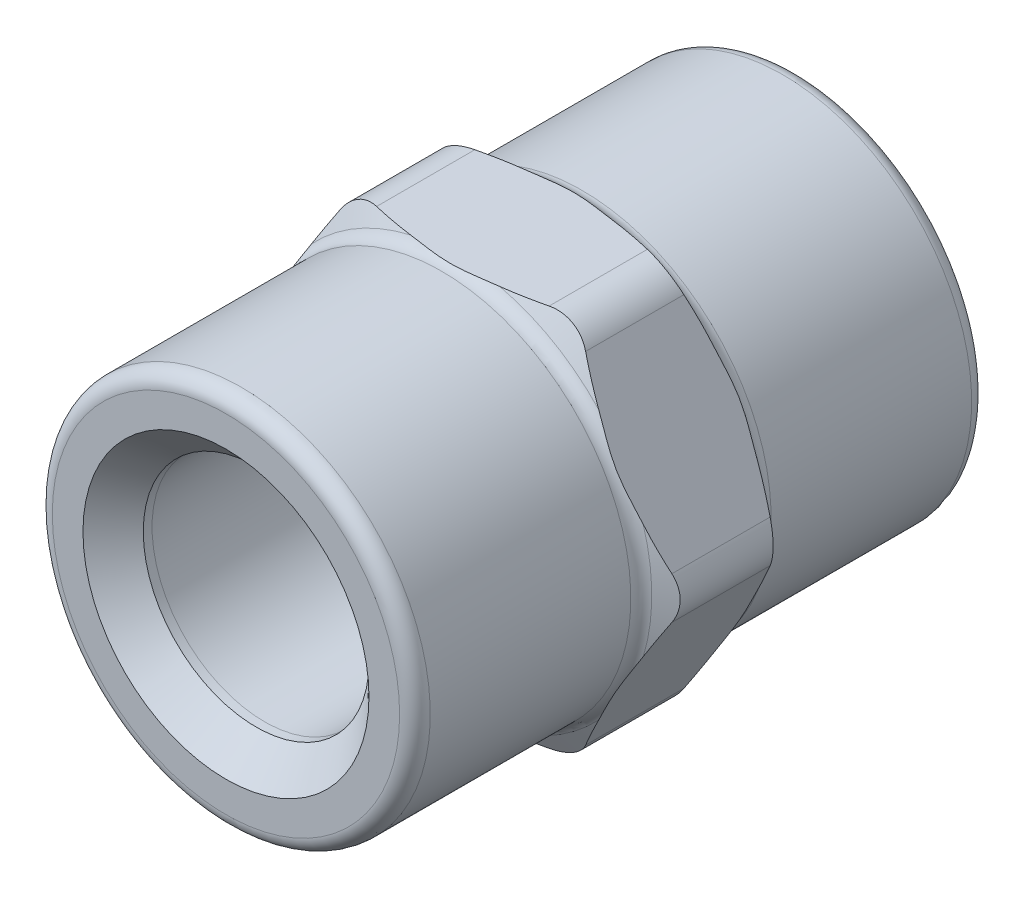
ISO-10303-21;
HEADER;
FILE_DESCRIPTION(('STEP AP214'),'2;1');
FILE_NAME('part.step','',(''),(''),'','','');
FILE_SCHEMA(('AUTOMOTIVE_DESIGN { 1 0 10303 214 1 1 1 1 }'));
ENDSEC;
DATA;
#1=APPLICATION_CONTEXT('core data for automotive mechanical design processes');
#2=APPLICATION_PROTOCOL_DEFINITION('international standard','automotive_design',2000,#1);
#3=PRODUCT_CONTEXT('',#1,'mechanical');
#4=PRODUCT('Part','Part','',(#3));
#5=PRODUCT_RELATED_PRODUCT_CATEGORY('part','',(#4));
#6=PRODUCT_DEFINITION_FORMATION('','',#4);
#7=PRODUCT_DEFINITION_CONTEXT('part definition',#1,'design');
#8=PRODUCT_DEFINITION('design','',#6,#7);
#9=PRODUCT_DEFINITION_SHAPE('','',#8);
#10=(LENGTH_UNIT() NAMED_UNIT(*) SI_UNIT(.MILLI.,.METRE.));
#11=(NAMED_UNIT(*) PLANE_ANGLE_UNIT() SI_UNIT($,.RADIAN.));
#12=(NAMED_UNIT(*) SI_UNIT($,.STERADIAN.) SOLID_ANGLE_UNIT());
#13=UNCERTAINTY_MEASURE_WITH_UNIT(LENGTH_MEASURE(1.E-05),#10,'distance_accuracy_value','');
#14=(GEOMETRIC_REPRESENTATION_CONTEXT(3) GLOBAL_UNCERTAINTY_ASSIGNED_CONTEXT((#13)) GLOBAL_UNIT_ASSIGNED_CONTEXT((#10,
#11,#12)) REPRESENTATION_CONTEXT('',''));
#15=CARTESIAN_POINT('',(0.,0.,0.));
#16=DIRECTION('',(0.,0.,1.));
#17=DIRECTION('',(1.,0.,0.));
#18=AXIS2_PLACEMENT_3D('',#15,#16,#17);
#19=CARTESIAN_POINT('',(4.2894238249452,7.4295,16.764485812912));
#20=DIRECTION('',(0.,0.,-1.));
#21=DIRECTION('',(-1.,0.,0.));
#22=AXIS2_PLACEMENT_3D('',#19,#20,#21);
#23=CYLINDRICAL_SURFACE('',#22,2.0955);
#24=DIRECTION('',(0.,0.,1.));
#25=VECTOR('',#24,1.);
#26=CARTESIAN_POINT('',(4.2894238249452,9.525,14.224));
#27=LINE('',#26,#25);
#28=CARTESIAN_POINT('',(4.28942382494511,9.525,16.6667748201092));
#29=VERTEX_POINT('',#28);
#30=CARTESIAN_POINT('',(4.28942382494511,9.525,11.7812251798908));
#31=VERTEX_POINT('',#30);
#32=EDGE_CURVE('E454',#29,#31,#27,.F.);
#33=ORIENTED_EDGE('',*,*,#32,.F.);
#34=CARTESIAN_POINT('',(6.10418005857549,8.47725,16.6667748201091));
#35=CARTESIAN_POINT('',(6.07753136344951,8.52340769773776,16.6541396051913));
#36=CARTESIAN_POINT('',(6.04903105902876,8.56870054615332,16.642337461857));
#37=CARTESIAN_POINT('',(5.98842505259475,8.65726132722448,16.6204688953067));
#38=CARTESIAN_POINT('',(5.95631854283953,8.7005288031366,16.6104028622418));
#39=CARTESIAN_POINT('',(5.85479952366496,8.82676508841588,16.58293316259));
#40=CARTESIAN_POINT('',(5.78015277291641,8.90622826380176,16.5682413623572));
#41=CARTESIAN_POINT('',(5.61867188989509,9.05312828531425,16.5465961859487));
#42=CARTESIAN_POINT('',(5.53181708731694,9.12054428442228,16.5396561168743));
#43=CARTESIAN_POINT('',(5.34846132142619,9.24101156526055,16.5337848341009));
#44=CARTESIAN_POINT('',(5.25196613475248,9.29407137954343,16.5348488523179));
#45=CARTESIAN_POINT('',(5.05450073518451,9.38328145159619,16.5448211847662));
#46=CARTESIAN_POINT('',(4.95368109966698,9.41978702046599,16.5535515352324));
#47=CARTESIAN_POINT('',(4.74851094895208,9.4768581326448,16.5783425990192));
#48=CARTESIAN_POINT('',(4.64416237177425,9.49743228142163,16.594399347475));
#49=CARTESIAN_POINT('',(4.49784034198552,9.51503668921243,16.6216207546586));
#50=CARTESIAN_POINT('',(4.45603457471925,9.51878608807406,16.6299340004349));
#51=CARTESIAN_POINT('',(4.37259298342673,9.52376396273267,16.6475895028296));
#52=CARTESIAN_POINT('',(4.33095699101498,9.52499835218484,16.6569292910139));
#53=CARTESIAN_POINT('',(4.28942382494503,9.525,16.6667748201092));
#54=B_SPLINE_CURVE_WITH_KNOTS('',3,(#34,#35,#36,#37,#38,#39,#40,#41,#42,#43,#44,#45,#46,#47,#48,
#49,#50,#51,#52,#53),.UNSPECIFIED.,.F.,.F.,(4,2,2,2,2,2,2,2,2,4),(0.,0.164237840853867,
0.328512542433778,0.656849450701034,0.985749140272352,1.31445291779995,1.63572219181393,
1.95681780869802,2.08511680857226,2.21311378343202),.UNSPECIFIED.);
#55=CARTESIAN_POINT('',(6.10418005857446,8.47724999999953,16.6667748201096));
#56=VERTEX_POINT('',#55);
#57=EDGE_CURVE('E560',#56,#29,#54,.T.);
#58=ORIENTED_EDGE('',*,*,#57,.F.);
#59=DIRECTION('',(0.,0.,1.));
#60=VECTOR('',#59,1.);
#61=CARTESIAN_POINT('',(6.10418005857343,8.47724999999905,14.2239999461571));
#62=LINE('',#61,#60);
#63=CARTESIAN_POINT('',(6.10418005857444,8.47724999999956,11.7812251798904));
#64=VERTEX_POINT('',#63);
#65=EDGE_CURVE('E451',#64,#56,#62,.T.);
#66=ORIENTED_EDGE('',*,*,#65,.F.);
#67=CARTESIAN_POINT('',(4.28942382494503,9.525,11.7812251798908));
#68=CARTESIAN_POINT('',(4.34272191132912,9.52500040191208,11.7938603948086));
#69=CARTESIAN_POINT('',(4.39619682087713,9.5229648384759,11.8056625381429));
#70=CARTESIAN_POINT('',(4.50319571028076,9.51475888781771,11.8275311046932));
#71=CARTESIAN_POINT('',(4.55671969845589,9.5085875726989,11.8375971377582));
#72=CARTESIAN_POINT('',(4.71680303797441,9.4837876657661,11.8650668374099));
#73=CARTESIAN_POINT('',(4.82294354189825,9.45887327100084,11.8797586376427));
#74=CARTESIAN_POINT('',(5.03090313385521,9.39247673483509,11.9014038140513));
#75=CARTESIAN_POINT('',(5.13271450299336,9.35096626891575,11.9083438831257));
#76=CARTESIAN_POINT('',(5.32872011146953,9.25240915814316,11.9142151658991));
#77=CARTESIAN_POINT('',(5.42291885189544,9.19537178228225,11.9131511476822));
#78=CARTESIAN_POINT('',(5.59890974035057,9.06896676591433,11.9031788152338));
#79=CARTESIAN_POINT('',(5.68093430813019,8.99990718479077,11.8944484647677));
#80=CARTESIAN_POINT('',(5.83294441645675,8.85076017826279,11.8696574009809));
#81=CARTESIAN_POINT('',(5.90293644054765,8.77067873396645,11.853600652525));
#82=CARTESIAN_POINT('',(5.99134331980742,8.65276234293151,11.8263792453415));
#83=CARTESIAN_POINT('',(6.01549327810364,8.61843218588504,11.8180659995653));
#84=CARTESIAN_POINT('',(6.06152503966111,8.54865858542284,11.8004104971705));
#85=CARTESIAN_POINT('',(6.08341204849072,8.51321795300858,11.7910707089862));
#86=CARTESIAN_POINT('',(6.10418005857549,8.47725,11.781225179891));
#87=B_SPLINE_CURVE_WITH_KNOTS('',3,(#67,#68,#69,#70,#71,#72,#73,#74,#75,#76,#77,#78,#79,#80,#81,
#82,#83,#84,#85,#86),.UNSPECIFIED.,.F.,.F.,(4,2,2,2,2,2,2,2,2,4),(0.,0.164237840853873,
0.328512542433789,0.656849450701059,0.985749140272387,1.31445291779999,1.63572219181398,
1.95681780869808,2.08511680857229,2.21311378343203),.UNSPECIFIED.);
#88=EDGE_CURVE('E200',#31,#64,#87,.T.);
#89=ORIENTED_EDGE('',*,*,#88,.F.);
#90=EDGE_LOOP('',(#33,#58,#66,#89));
#91=FACE_BOUND('',#90,.T.);
#92=ADVANCED_FACE('F16',(#91),#23,.T.);
#93=CARTESIAN_POINT('',(8.57884764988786,0.,16.764485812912));
#94=DIRECTION('',(0.,0.,-1.));
#95=DIRECTION('',(-1.,0.,0.));
#96=AXIS2_PLACEMENT_3D('',#93,#94,#95);
#97=CYLINDRICAL_SURFACE('',#96,2.09549999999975);
#98=DIRECTION('',(0.,0.,1.));
#99=VECTOR('',#98,1.);
#100=CARTESIAN_POINT('',(10.3936038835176,1.04774999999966,14.2239999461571));
#101=LINE('',#100,#99);
#102=CARTESIAN_POINT('',(10.3936038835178,1.04774999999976,16.6667748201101));
#103=VERTEX_POINT('',#102);
#104=CARTESIAN_POINT('',(10.3936038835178,1.04774999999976,11.78122517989));
#105=VERTEX_POINT('',#104);
#106=EDGE_CURVE('E448',#103,#105,#101,.F.);
#107=ORIENTED_EDGE('',*,*,#106,.F.);
#108=CARTESIAN_POINT('',(10.3936038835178,-1.04775000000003,16.6667748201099));
#109=CARTESIAN_POINT('',(10.420253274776,-1.00159270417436,16.6541396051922));
#110=CARTESIAN_POINT('',(10.4452278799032,-0.954264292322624,16.6423374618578));
#111=CARTESIAN_POINT('',(10.4916207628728,-0.857497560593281,16.6204688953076));
#112=CARTESIAN_POINT('',(10.5130382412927,-0.808058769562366,16.6104028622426));
#113=CARTESIAN_POINT('',(10.5716025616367,-0.657022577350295,16.5829331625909));
#114=CARTESIAN_POINT('',(10.603096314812,-0.55264500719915,16.5682413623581));
#115=CARTESIAN_POINT('',(10.6495750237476,-0.339348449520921,16.5465961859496));
#116=CARTESIAN_POINT('',(10.6645315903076,-0.230421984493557,16.5396561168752));
#117=CARTESIAN_POINT('',(10.677181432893,-0.0113975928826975,16.5337848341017));
#118=CARTESIAN_POINT('',(10.6748849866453,0.0986995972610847,16.5348488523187));
#119=CARTESIAN_POINT('',(10.6534104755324,0.314314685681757,16.544821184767));
#120=CARTESIAN_POINT('',(10.6346154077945,0.419879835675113,16.5535515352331));
#121=CARTESIAN_POINT('',(10.5814553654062,0.626097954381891,16.57834259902));
#122=CARTESIAN_POINT('',(10.5470988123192,0.72675354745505,16.5943993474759));
#123=CARTESIAN_POINT('',(10.4891836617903,0.862274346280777,16.6216207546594));
#124=CARTESIAN_POINT('',(10.4715278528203,0.900353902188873,16.6299340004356));
#125=CARTESIAN_POINT('',(10.4341180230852,0.975105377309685,16.6475895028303));
#126=CARTESIAN_POINT('',(10.4143690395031,1.01178039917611,16.6569292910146));
#127=CARTESIAN_POINT('',(10.3936038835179,1.04774999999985,16.6667748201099));
#128=B_SPLINE_CURVE_WITH_KNOTS('',3,(#108,#109,#110,#111,#112,#113,#114,#115,#116,#117,#118,
#119,#120,#121,#122,#123,#124,#125,#126,#127),.UNSPECIFIED.,.F.,.F.,(4,2,2,2,2,2,2,2,2,4),(0.,
0.164237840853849,0.328512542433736,0.656849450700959,0.985749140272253,1.31445291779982,
1.63572219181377,1.95681780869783,2.08511680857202,2.21311378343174),.UNSPECIFIED.);
#129=CARTESIAN_POINT('',(10.3936038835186,-1.04775000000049,16.6667748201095));
#130=VERTEX_POINT('',#129);
#131=EDGE_CURVE('E602',#130,#103,#128,.T.);
#132=ORIENTED_EDGE('',*,*,#131,.F.);
#133=DIRECTION('',(0.,0.,1.));
#134=VECTOR('',#133,1.);
#135=CARTESIAN_POINT('',(10.3936038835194,-1.04775000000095,14.2240000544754));
#136=LINE('',#135,#134);
#137=CARTESIAN_POINT('',(10.3936035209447,-1.04775062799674,11.7812250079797));
#138=VERTEX_POINT('',#137);
#139=EDGE_CURVE('E445',#138,#130,#136,.T.);
#140=ORIENTED_EDGE('',*,*,#139,.F.);
#141=CARTESIAN_POINT('',(10.3936038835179,1.04774999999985,11.7812251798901));
#142=CARTESIAN_POINT('',(10.4202532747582,1.00159270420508,11.7938603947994));
#143=CARTESIAN_POINT('',(10.4452278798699,0.954264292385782,11.8056625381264));
#144=CARTESIAN_POINT('',(10.4916207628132,0.857497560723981,11.8275311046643));
#145=CARTESIAN_POINT('',(10.5130382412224,0.808058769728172,11.8375971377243));
#146=CARTESIAN_POINT('',(10.5716025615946,0.65702257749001,11.8650668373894));
#147=CARTESIAN_POINT('',(10.6030963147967,0.552645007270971,11.8797586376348));
#148=CARTESIAN_POINT('',(10.6495750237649,0.339348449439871,11.9014038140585));
#149=CARTESIAN_POINT('',(10.6645315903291,0.230421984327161,11.9083438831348));
#150=CARTESIAN_POINT('',(10.6771814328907,0.0113975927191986,11.9142151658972));
#151=CARTESIAN_POINT('',(10.6748849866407,-0.098699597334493,11.9131511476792));
#152=CARTESIAN_POINT('',(10.6534104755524,-0.314314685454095,11.9031788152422));
#153=CARTESIAN_POINT('',(10.6346154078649,-0.419879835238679,11.8944484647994));
#154=CARTESIAN_POINT('',(10.5814553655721,-0.626097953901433,11.8696574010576));
#155=CARTESIAN_POINT('',(10.5470988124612,-0.726753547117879,11.8536006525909));
#156=CARTESIAN_POINT('',(10.4891836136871,-0.862274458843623,11.826379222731));
#157=CARTESIAN_POINT('',(10.4715277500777,-0.900354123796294,11.818065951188));
#158=CARTESIAN_POINT('',(10.4341177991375,-0.975105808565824,11.8004103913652));
#159=CARTESIAN_POINT('',(10.4143687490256,-1.01178093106,11.7910705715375));
#160=CARTESIAN_POINT('',(10.393603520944,-1.04775062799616,11.7812250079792));
#161=B_SPLINE_CURVE_WITH_KNOTS('',3,(#141,#142,#143,#144,#145,#146,#147,#148,#149,#150,#151,
#152,#153,#154,#155,#156,#157,#158,#159,#160),.UNSPECIFIED.,.F.,.F.,(4,2,2,2,2,2,2,2,2,4),(0.,
0.164237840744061,0.328512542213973,0.656849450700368,0.985749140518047,1.31445291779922,
1.6357221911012,1.95681780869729,2.0851171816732,2.21311452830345),.UNSPECIFIED.);
#162=EDGE_CURVE('E281',#105,#138,#161,.T.);
#163=ORIENTED_EDGE('',*,*,#162,.F.);
#164=EDGE_LOOP('',(#107,#132,#140,#163));
#165=FACE_BOUND('',#164,.T.);
#166=ADVANCED_FACE('F606',(#165),#97,.T.);
#167=CARTESIAN_POINT('',(4.2894238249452,-7.4295,16.764485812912));
#168=DIRECTION('',(0.,0.,-1.));
#169=DIRECTION('',(-1.,0.,0.));
#170=AXIS2_PLACEMENT_3D('',#167,#168,#169);
#171=CYLINDRICAL_SURFACE('',#170,2.09549999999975);
#172=DIRECTION('',(0.,0.,1.));
#173=VECTOR('',#172,1.);
#174=CARTESIAN_POINT('',(6.10418005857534,-8.47725000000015,14.2240000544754));
#175=LINE('',#174,#173);
#176=CARTESIAN_POINT('',(6.1041800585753,-8.47725,16.6667748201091));
#177=VERTEX_POINT('',#176);
#178=CARTESIAN_POINT('',(6.1041800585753,-8.47725,11.7812251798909));
#179=VERTEX_POINT('',#178);
#180=EDGE_CURVE('E442',#177,#179,#175,.F.);
#181=ORIENTED_EDGE('',*,*,#180,.F.);
#182=CARTESIAN_POINT('',(4.28942382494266,-9.52499999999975,16.6667748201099));
#183=CARTESIAN_POINT('',(4.34272191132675,-9.52500040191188,16.6541396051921));
#184=CARTESIAN_POINT('',(4.39619682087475,-9.52296483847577,16.6423374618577));
#185=CARTESIAN_POINT('',(4.50319571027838,-9.5147588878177,16.6204688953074));
#186=CARTESIAN_POINT('',(4.55671969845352,-9.50858757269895,16.6104028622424));
#187=CARTESIAN_POINT('',(4.71680303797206,-9.48378766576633,16.5829331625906));
#188=CARTESIAN_POINT('',(4.82294354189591,-9.45887327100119,16.5682413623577));
#189=CARTESIAN_POINT('',(5.03090313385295,-9.39247673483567,16.546596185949));
#190=CARTESIAN_POINT('',(5.13271450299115,-9.35096626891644,16.5396561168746));
#191=CARTESIAN_POINT('',(5.32872011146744,-9.25240915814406,16.5337848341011));
#192=CARTESIAN_POINT('',(5.42291885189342,-9.19537178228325,16.5348488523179));
#193=CARTESIAN_POINT('',(5.59890974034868,-9.06896676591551,16.5448211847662));
#194=CARTESIAN_POINT('',(5.68093430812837,-8.99990718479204,16.5535515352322));
#195=CARTESIAN_POINT('',(5.83294441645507,-8.85076017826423,16.578342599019));
#196=CARTESIAN_POINT('',(5.90293644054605,-8.77067873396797,16.5943993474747));
#197=CARTESIAN_POINT('',(5.99134331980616,-8.65276234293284,16.6216207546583));
#198=CARTESIAN_POINT('',(6.01549327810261,-8.6184321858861,16.6299340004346));
#199=CARTESIAN_POINT('',(6.0615250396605,-8.54865858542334,16.6475895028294));
#200=CARTESIAN_POINT('',(6.08341204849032,-8.51321795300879,16.6569292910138));
#201=CARTESIAN_POINT('',(6.10418005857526,-8.47724999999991,16.6667748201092));
#202=B_SPLINE_CURVE_WITH_KNOTS('',3,(#182,#183,#184,#185,#186,#187,#188,#189,#190,#191,#192,
#193,#194,#195,#196,#197,#198,#199,#200,#201),.UNSPECIFIED.,.F.,.F.,(4,2,2,2,2,2,2,2,2,4),(0.,
0.164237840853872,0.32851254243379,0.656849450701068,0.98574914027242,1.31445291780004,
1.635722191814,1.95681780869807,2.08511680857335,2.21311378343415),.UNSPECIFIED.);
#203=CARTESIAN_POINT('',(4.28942382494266,-9.52499999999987,16.6667748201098));
#204=VERTEX_POINT('',#203);
#205=EDGE_CURVE('E327',#204,#177,#202,.T.);
#206=ORIENTED_EDGE('',*,*,#205,.F.);
#207=DIRECTION('',(0.,0.,1.));
#208=VECTOR('',#207,1.);
#209=CARTESIAN_POINT('',(4.28942382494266,-9.525,14.2240000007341));
#210=LINE('',#209,#208);
#211=CARTESIAN_POINT('',(4.28942382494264,-9.52499999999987,11.7812251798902));
#212=VERTEX_POINT('',#211);
#213=EDGE_CURVE('E433',#204,#212,#210,.F.);
#214=ORIENTED_EDGE('',*,*,#213,.T.);
#215=CARTESIAN_POINT('',(6.10418005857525,-8.4772499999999,11.7812251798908));
#216=CARTESIAN_POINT('',(6.07753136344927,-8.52340769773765,11.7938603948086));
#217=CARTESIAN_POINT('',(6.04903105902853,-8.5687005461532,11.8056625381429));
#218=CARTESIAN_POINT('',(5.98842505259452,-8.65726132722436,11.8275311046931));
#219=CARTESIAN_POINT('',(5.95631854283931,-8.70052880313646,11.8375971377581));
#220=CARTESIAN_POINT('',(5.85479952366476,-8.82676508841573,11.8650668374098));
#221=CARTESIAN_POINT('',(5.78015277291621,-8.90622826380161,11.8797586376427));
#222=CARTESIAN_POINT('',(5.61867188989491,-9.05312828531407,11.9014038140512));
#223=CARTESIAN_POINT('',(5.53181708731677,-9.12054428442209,11.9083438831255));
#224=CARTESIAN_POINT('',(5.34846132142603,-9.24101156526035,11.914215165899));
#225=CARTESIAN_POINT('',(5.25196613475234,-9.29407137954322,11.913151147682));
#226=CARTESIAN_POINT('',(5.05450073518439,-9.38328145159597,11.9031788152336));
#227=CARTESIAN_POINT('',(4.95368109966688,-9.41978702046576,11.8944484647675));
#228=CARTESIAN_POINT('',(4.74851094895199,-9.47685813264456,11.8696574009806));
#229=CARTESIAN_POINT('',(4.64416237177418,-9.49743228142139,11.8536006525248));
#230=CARTESIAN_POINT('',(4.49784034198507,-9.51503668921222,11.8263792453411));
#231=CARTESIAN_POINT('',(4.45603457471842,-9.51878608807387,11.8180659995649));
#232=CARTESIAN_POINT('',(4.37259298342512,-9.52376396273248,11.8004104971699));
#233=CARTESIAN_POINT('',(4.33095699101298,-9.52499835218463,11.7910707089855));
#234=CARTESIAN_POINT('',(4.28942382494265,-9.52499999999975,11.7812251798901));
#235=B_SPLINE_CURVE_WITH_KNOTS('',3,(#215,#216,#217,#218,#219,#220,#221,#222,#223,#224,#225,
#226,#227,#228,#229,#230,#231,#232,#233,#234),.UNSPECIFIED.,.F.,.F.,(4,2,2,2,2,2,2,2,2,4),(0.,
0.164237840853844,0.328512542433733,0.656849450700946,0.985749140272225,1.31445291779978,
1.63572219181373,1.95681780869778,2.08511680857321,2.21311378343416),.UNSPECIFIED.);
#236=EDGE_CURVE('E616',#179,#212,#235,.T.);
#237=ORIENTED_EDGE('',*,*,#236,.F.);
#238=EDGE_LOOP('',(#181,#206,#214,#237));
#239=FACE_BOUND('',#238,.T.);
#240=ADVANCED_FACE('F609',(#239),#171,.T.);
#241=CARTESIAN_POINT('',(-4.2894238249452,-7.4295,16.764485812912));
#242=DIRECTION('',(0.,0.,-1.));
#243=DIRECTION('',(-1.,0.,0.));
#244=AXIS2_PLACEMENT_3D('',#241,#242,#243);
#245=CYLINDRICAL_SURFACE('',#244,2.0955);
#246=DIRECTION('',(0.,0.,1.));
#247=VECTOR('',#246,1.);
#248=CARTESIAN_POINT('',(-4.2894238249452,-9.525,14.2240000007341));
#249=LINE('',#248,#247);
#250=CARTESIAN_POINT('',(-4.28942382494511,-9.525,11.7812251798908));
#251=VERTEX_POINT('',#250);
#252=CARTESIAN_POINT('',(-4.28942382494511,-9.525,16.6667748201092));
#253=VERTEX_POINT('',#252);
#254=EDGE_CURVE('E438',#251,#253,#249,.T.);
#255=ORIENTED_EDGE('',*,*,#254,.T.);
#256=CARTESIAN_POINT('',(-6.10418005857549,-8.47725,16.6667748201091));
#257=CARTESIAN_POINT('',(-6.07753136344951,-8.52340769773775,16.6541396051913));
#258=CARTESIAN_POINT('',(-6.04903105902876,-8.56870054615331,16.6423374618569));
#259=CARTESIAN_POINT('',(-5.98842505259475,-8.65726132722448,16.6204688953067));
#260=CARTESIAN_POINT('',(-5.95631854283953,-8.70052880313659,16.6104028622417));
#261=CARTESIAN_POINT('',(-5.85479952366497,-8.82676508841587,16.58293316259));
#262=CARTESIAN_POINT('',(-5.78015277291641,-8.90622826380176,16.5682413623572));
#263=CARTESIAN_POINT('',(-5.61867188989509,-9.05312828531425,16.5465961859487));
#264=CARTESIAN_POINT('',(-5.53181708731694,-9.12054428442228,16.5396561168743));
#265=CARTESIAN_POINT('',(-5.34846132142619,-9.24101156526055,16.5337848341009));
#266=CARTESIAN_POINT('',(-5.25196613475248,-9.29407137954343,16.5348488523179));
#267=CARTESIAN_POINT('',(-5.05450073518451,-9.38328145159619,16.5448211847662));
#268=CARTESIAN_POINT('',(-4.95368109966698,-9.41978702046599,16.5535515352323));
#269=CARTESIAN_POINT('',(-4.74851094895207,-9.47685813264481,16.5783425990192));
#270=CARTESIAN_POINT('',(-4.64416237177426,-9.49743228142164,16.5943993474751));
#271=CARTESIAN_POINT('',(-4.49784034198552,-9.51503668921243,16.6216207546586));
#272=CARTESIAN_POINT('',(-4.45603457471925,-9.51878608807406,16.6299340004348));
#273=CARTESIAN_POINT('',(-4.37259298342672,-9.52376396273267,16.6475895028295));
#274=CARTESIAN_POINT('',(-4.33095699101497,-9.52499835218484,16.6569292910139));
#275=CARTESIAN_POINT('',(-4.28942382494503,-9.525,16.6667748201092));
#276=B_SPLINE_CURVE_WITH_KNOTS('',3,(#256,#257,#258,#259,#260,#261,#262,#263,#264,#265,#266,
#267,#268,#269,#270,#271,#272,#273,#274,#275),.UNSPECIFIED.,.F.,.F.,(4,2,2,2,2,2,2,2,2,4),(0.,
0.16423784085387,0.32851254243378,0.656849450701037,0.985749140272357,1.31445291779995,
1.63572219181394,1.95681780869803,2.08511680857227,2.21311378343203),.UNSPECIFIED.);
#277=CARTESIAN_POINT('',(-6.10418005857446,-8.47724999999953,16.6667748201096));
#278=VERTEX_POINT('',#277);
#279=EDGE_CURVE('E436',#278,#253,#276,.T.);
#280=ORIENTED_EDGE('',*,*,#279,.F.);
#281=DIRECTION('',(0.,0.,1.));
#282=VECTOR('',#281,1.);
#283=CARTESIAN_POINT('',(-6.10418005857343,-8.47724999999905,14.2239999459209));
#284=LINE('',#283,#282);
#285=CARTESIAN_POINT('',(-6.10418005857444,-8.47724999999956,11.7812251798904));
#286=VERTEX_POINT('',#285);
#287=EDGE_CURVE('E425',#278,#286,#284,.F.);
#288=ORIENTED_EDGE('',*,*,#287,.T.);
#289=CARTESIAN_POINT('',(-4.28942382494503,-9.525,11.7812251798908));
#290=CARTESIAN_POINT('',(-4.34272191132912,-9.52500040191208,11.7938603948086));
#291=CARTESIAN_POINT('',(-4.39619682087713,-9.5229648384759,11.8056625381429));
#292=CARTESIAN_POINT('',(-4.50319571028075,-9.51475888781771,11.8275311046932));
#293=CARTESIAN_POINT('',(-4.55671969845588,-9.50858757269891,11.8375971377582));
#294=CARTESIAN_POINT('',(-4.7168030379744,-9.4837876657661,11.8650668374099));
#295=CARTESIAN_POINT('',(-4.82294354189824,-9.45887327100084,11.8797586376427));
#296=CARTESIAN_POINT('',(-5.03090313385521,-9.39247673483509,11.9014038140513));
#297=CARTESIAN_POINT('',(-5.13271450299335,-9.35096626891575,11.9083438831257));
#298=CARTESIAN_POINT('',(-5.32872011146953,-9.25240915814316,11.9142151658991));
#299=CARTESIAN_POINT('',(-5.42291885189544,-9.19537178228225,11.9131511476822));
#300=CARTESIAN_POINT('',(-5.59890974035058,-9.06896676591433,11.9031788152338));
#301=CARTESIAN_POINT('',(-5.68093430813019,-8.99990718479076,11.8944484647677));
#302=CARTESIAN_POINT('',(-5.83294441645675,-8.85076017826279,11.8696574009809));
#303=CARTESIAN_POINT('',(-5.90293644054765,-8.77067873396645,11.853600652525));
#304=CARTESIAN_POINT('',(-5.99134331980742,-8.65276234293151,11.8263792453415));
#305=CARTESIAN_POINT('',(-6.01549327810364,-8.61843218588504,11.8180659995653));
#306=CARTESIAN_POINT('',(-6.06152503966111,-8.54865858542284,11.8004104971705));
#307=CARTESIAN_POINT('',(-6.08341204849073,-8.51321795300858,11.7910707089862));
#308=CARTESIAN_POINT('',(-6.10418005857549,-8.47725,11.781225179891));
#309=B_SPLINE_CURVE_WITH_KNOTS('',3,(#289,#290,#291,#292,#293,#294,#295,#296,#297,#298,#299,
#300,#301,#302,#303,#304,#305,#306,#307,#308),.UNSPECIFIED.,.F.,.F.,(4,2,2,2,2,2,2,2,2,4),(0.,
0.164237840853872,0.328512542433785,0.65684945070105,0.985749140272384,1.31445291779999,
1.63572219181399,1.95681780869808,2.08511680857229,2.21311378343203),.UNSPECIFIED.);
#310=EDGE_CURVE('E621',#251,#286,#309,.T.);
#311=ORIENTED_EDGE('',*,*,#310,.F.);
#312=EDGE_LOOP('',(#255,#280,#288,#311));
#313=FACE_BOUND('',#312,.T.);
#314=ADVANCED_FACE('F270',(#313),#245,.T.);
#315=CARTESIAN_POINT('',(-4.2894238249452,7.4295,16.764485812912));
#316=DIRECTION('',(0.,0.,-1.));
#317=DIRECTION('',(-1.,0.,0.));
#318=AXIS2_PLACEMENT_3D('',#315,#316,#317);
#319=CYLINDRICAL_SURFACE('',#318,2.09549999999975);
#320=DIRECTION('',(0.,0.,1.));
#321=VECTOR('',#320,1.);
#322=CARTESIAN_POINT('',(-6.10418005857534,8.47725000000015,14.2240000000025));
#323=LINE('',#322,#321);
#324=CARTESIAN_POINT('',(-6.1041800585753,8.47725,11.7812251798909));
#325=VERTEX_POINT('',#324);
#326=CARTESIAN_POINT('',(-6.10418005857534,8.47725,16.6667748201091));
#327=VERTEX_POINT('',#326);
#328=EDGE_CURVE('E194',#325,#327,#323,.T.);
#329=ORIENTED_EDGE('',*,*,#328,.T.);
#330=CARTESIAN_POINT('',(-4.28942382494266,9.52499999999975,16.6667748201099));
#331=CARTESIAN_POINT('',(-4.34272191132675,9.52500040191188,16.6541396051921));
#332=CARTESIAN_POINT('',(-4.39619682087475,9.52296483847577,16.6423374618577));
#333=CARTESIAN_POINT('',(-4.50319571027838,9.5147588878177,16.6204688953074));
#334=CARTESIAN_POINT('',(-4.55671969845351,9.50858757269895,16.6104028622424));
#335=CARTESIAN_POINT('',(-4.71680303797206,9.48378766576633,16.5829331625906));
#336=CARTESIAN_POINT('',(-4.82294354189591,9.45887327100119,16.5682413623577));
#337=CARTESIAN_POINT('',(-5.03090313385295,9.39247673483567,16.546596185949));
#338=CARTESIAN_POINT('',(-5.13271450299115,9.35096626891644,16.5396561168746));
#339=CARTESIAN_POINT('',(-5.32872011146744,9.25240915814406,16.5337848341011));
#340=CARTESIAN_POINT('',(-5.42291885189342,9.19537178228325,16.5348488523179));
#341=CARTESIAN_POINT('',(-5.59890974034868,9.06896676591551,16.5448211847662));
#342=CARTESIAN_POINT('',(-5.68093430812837,8.99990718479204,16.5535515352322));
#343=CARTESIAN_POINT('',(-5.83294441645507,8.85076017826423,16.578342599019));
#344=CARTESIAN_POINT('',(-5.90293644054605,8.77067873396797,16.5943993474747));
#345=CARTESIAN_POINT('',(-5.99134331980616,8.65276234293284,16.6216207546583));
#346=CARTESIAN_POINT('',(-6.01549327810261,8.6184321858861,16.6299340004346));
#347=CARTESIAN_POINT('',(-6.0615250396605,8.54865858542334,16.6475895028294));
#348=CARTESIAN_POINT('',(-6.08341204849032,8.51321795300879,16.6569292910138));
#349=CARTESIAN_POINT('',(-6.10418005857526,8.47724999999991,16.6667748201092));
#350=B_SPLINE_CURVE_WITH_KNOTS('',3,(#330,#331,#332,#333,#334,#335,#336,#337,#338,#339,#340,
#341,#342,#343,#344,#345,#346,#347,#348,#349),.UNSPECIFIED.,.F.,.F.,(4,2,2,2,2,2,2,2,2,4),(0.,
0.164237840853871,0.32851254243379,0.656849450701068,0.98574914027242,1.31445291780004,
1.635722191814,1.95681780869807,2.08511680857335,2.21311378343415),.UNSPECIFIED.);
#351=CARTESIAN_POINT('',(-4.28942382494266,9.52499999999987,16.6667748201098));
#352=VERTEX_POINT('',#351);
#353=EDGE_CURVE('E275',#352,#327,#350,.T.);
#354=ORIENTED_EDGE('',*,*,#353,.F.);
#355=DIRECTION('',(0.,0.,1.));
#356=VECTOR('',#355,1.);
#357=CARTESIAN_POINT('',(-4.28942382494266,9.525,14.224));
#358=LINE('',#357,#356);
#359=CARTESIAN_POINT('',(-4.28942382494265,9.52499999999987,11.7812251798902));
#360=VERTEX_POINT('',#359);
#361=EDGE_CURVE('E195',#360,#352,#358,.T.);
#362=ORIENTED_EDGE('',*,*,#361,.F.);
#363=CARTESIAN_POINT('',(-6.10418005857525,8.4772499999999,11.7812251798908));
#364=CARTESIAN_POINT('',(-6.07753136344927,8.52340769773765,11.7938603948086));
#365=CARTESIAN_POINT('',(-6.04903105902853,8.56870054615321,11.8056625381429));
#366=CARTESIAN_POINT('',(-5.98842505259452,8.65726132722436,11.8275311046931));
#367=CARTESIAN_POINT('',(-5.95631854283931,8.70052880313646,11.8375971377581));
#368=CARTESIAN_POINT('',(-5.85479952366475,8.82676508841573,11.8650668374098));
#369=CARTESIAN_POINT('',(-5.78015277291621,8.90622826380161,11.8797586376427));
#370=CARTESIAN_POINT('',(-5.61867188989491,9.05312828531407,11.9014038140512));
#371=CARTESIAN_POINT('',(-5.53181708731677,9.12054428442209,11.9083438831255));
#372=CARTESIAN_POINT('',(-5.34846132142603,9.24101156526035,11.914215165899));
#373=CARTESIAN_POINT('',(-5.25196613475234,9.29407137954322,11.913151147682));
#374=CARTESIAN_POINT('',(-5.05450073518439,9.38328145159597,11.9031788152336));
#375=CARTESIAN_POINT('',(-4.95368109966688,9.41978702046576,11.8944484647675));
#376=CARTESIAN_POINT('',(-4.74851094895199,9.47685813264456,11.8696574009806));
#377=CARTESIAN_POINT('',(-4.64416237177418,9.49743228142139,11.8536006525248));
#378=CARTESIAN_POINT('',(-4.49784034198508,9.51503668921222,11.8263792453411));
#379=CARTESIAN_POINT('',(-4.45603457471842,9.51878608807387,11.8180659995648));
#380=CARTESIAN_POINT('',(-4.37259298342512,9.52376396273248,11.8004104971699));
#381=CARTESIAN_POINT('',(-4.33095699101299,9.52499835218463,11.7910707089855));
#382=CARTESIAN_POINT('',(-4.28942382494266,9.52499999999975,11.7812251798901));
#383=B_SPLINE_CURVE_WITH_KNOTS('',3,(#363,#364,#365,#366,#367,#368,#369,#370,#371,#372,#373,
#374,#375,#376,#377,#378,#379,#380,#381,#382),.UNSPECIFIED.,.F.,.F.,(4,2,2,2,2,2,2,2,2,4),(0.,
0.164237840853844,0.328512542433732,0.656849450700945,0.985749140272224,1.31445291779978,
1.63572219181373,1.95681780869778,2.08511680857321,2.21311378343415),.UNSPECIFIED.);
#384=EDGE_CURVE('E190',#325,#360,#383,.T.);
#385=ORIENTED_EDGE('',*,*,#384,.F.);
#386=EDGE_LOOP('',(#329,#354,#362,#385));
#387=FACE_BOUND('',#386,.T.);
#388=ADVANCED_FACE('F192',(#387),#319,.T.);
#389=CARTESIAN_POINT('',(-8.57884764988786,0.,16.764485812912));
#390=DIRECTION('',(0.,0.,-1.));
#391=DIRECTION('',(-1.,0.,0.));
#392=AXIS2_PLACEMENT_3D('',#389,#390,#391);
#393=CYLINDRICAL_SURFACE('',#392,2.09549999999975);
#394=DIRECTION('',(0.,0.,1.));
#395=VECTOR('',#394,1.);
#396=CARTESIAN_POINT('',(-10.393603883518,-1.0477499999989,14.2239999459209));
#397=LINE('',#396,#395);
#398=CARTESIAN_POINT('',(-10.3936038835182,-1.04774999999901,11.7812251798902));
#399=VERTEX_POINT('',#398);
#400=CARTESIAN_POINT('',(-10.3936035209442,-1.04775062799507,16.6667749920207));
#401=VERTEX_POINT('',#400);
#402=EDGE_CURVE('E430',#399,#401,#397,.T.);
#403=ORIENTED_EDGE('',*,*,#402,.T.);
#404=CARTESIAN_POINT('',(-10.3936038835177,1.04775000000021,16.66677482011));
#405=CARTESIAN_POINT('',(-10.4202532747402,1.00159270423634,16.6541396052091));
#406=CARTESIAN_POINT('',(-10.4452278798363,0.954264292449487,16.6423374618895));
#407=CARTESIAN_POINT('',(-10.4916207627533,0.857497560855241,16.6204688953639));
#408=CARTESIAN_POINT('',(-10.5130382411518,0.808058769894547,16.6104028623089));
#409=CARTESIAN_POINT('',(-10.5716025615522,0.657022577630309,16.5829331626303));
#410=CARTESIAN_POINT('',(-10.6030963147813,0.552645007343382,16.5682413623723));
#411=CARTESIAN_POINT('',(-10.649575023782,0.33934844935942,16.5465961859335));
#412=CARTESIAN_POINT('',(-10.6645315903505,0.230421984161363,16.5396561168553));
#413=CARTESIAN_POINT('',(-10.6771814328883,0.0113975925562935,16.5337848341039));
#414=CARTESIAN_POINT('',(-10.6748849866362,-0.0986995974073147,16.5348488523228));
#415=CARTESIAN_POINT('',(-10.6534104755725,-0.314314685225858,16.5448211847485));
#416=CARTESIAN_POINT('',(-10.6346154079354,-0.419879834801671,16.5535515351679));
#417=CARTESIAN_POINT('',(-10.5814553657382,-0.626097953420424,16.5783425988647));
#418=CARTESIAN_POINT('',(-10.5470988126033,-0.726753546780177,16.5943993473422));
#419=CARTESIAN_POINT('',(-10.4891835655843,-0.862274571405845,16.6216207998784));
#420=CARTESIAN_POINT('',(-10.4715276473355,-0.900354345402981,16.6299340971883));
#421=CARTESIAN_POINT('',(-10.4341175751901,-0.97510623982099,16.647589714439));
#422=CARTESIAN_POINT('',(-10.4143684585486,-1.01178146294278,16.6569295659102));
#423=CARTESIAN_POINT('',(-10.3936031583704,-1.04775125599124,16.6667751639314));
#424=B_SPLINE_CURVE_WITH_KNOTS('',3,(#404,#405,#406,#407,#408,#409,#410,#411,#412,#413,#414,
#415,#416,#417,#418,#419,#420,#421,#422,#423),.UNSPECIFIED.,.F.,.F.,(4,2,2,2,2,2,2,2,2,4),(0.,
0.164237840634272,0.328512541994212,0.656849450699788,0.985749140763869,1.31445291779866,
1.63572219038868,1.95681780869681,2.08511755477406,2.2131152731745),.UNSPECIFIED.);
#425=CARTESIAN_POINT('',(-10.3936038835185,1.04775000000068,16.6667748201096));
#426=VERTEX_POINT('',#425);
#427=EDGE_CURVE('E217',#426,#401,#424,.T.);
#428=ORIENTED_EDGE('',*,*,#427,.F.);
#429=DIRECTION('',(0.,0.,1.));
#430=VECTOR('',#429,1.);
#431=CARTESIAN_POINT('',(-10.3936038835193,1.04775000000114,14.2240000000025));
#432=LINE('',#431,#430);
#433=CARTESIAN_POINT('',(-10.3936038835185,1.04775000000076,11.7812251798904));
#434=VERTEX_POINT('',#433);
#435=EDGE_CURVE('E421',#426,#434,#432,.F.);
#436=ORIENTED_EDGE('',*,*,#435,.T.);
#437=CARTESIAN_POINT('',(-10.3936038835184,-1.04774999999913,11.7812251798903));
#438=CARTESIAN_POINT('',(-10.4202532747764,-1.00159270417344,11.793860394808));
#439=CARTESIAN_POINT('',(-10.4452278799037,-0.9542642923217,11.8056625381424));
#440=CARTESIAN_POINT('',(-10.4916207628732,-0.857497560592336,11.8275311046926));
#441=CARTESIAN_POINT('',(-10.5130382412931,-0.80805876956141,11.8375971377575));
#442=CARTESIAN_POINT('',(-10.571602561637,-0.657022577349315,11.8650668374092));
#443=CARTESIAN_POINT('',(-10.6030963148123,-0.552645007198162,11.879758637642));
#444=CARTESIAN_POINT('',(-10.6495750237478,-0.339348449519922,11.9014038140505));
#445=CARTESIAN_POINT('',(-10.6645315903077,-0.230421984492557,11.9083438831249));
#446=CARTESIAN_POINT('',(-10.6771814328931,-0.0113975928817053,11.9142151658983));
#447=CARTESIAN_POINT('',(-10.6748849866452,0.0986995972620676,11.9131511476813));
#448=CARTESIAN_POINT('',(-10.6534104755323,0.314314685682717,11.9031788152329));
#449=CARTESIAN_POINT('',(-10.6346154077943,0.419879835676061,11.8944484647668));
#450=CARTESIAN_POINT('',(-10.5814553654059,0.626097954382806,11.8696574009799));
#451=CARTESIAN_POINT('',(-10.5470988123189,0.726753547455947,11.853600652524));
#452=CARTESIAN_POINT('',(-10.4891836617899,0.862274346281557,11.8263792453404));
#453=CARTESIAN_POINT('',(-10.4715278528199,0.900353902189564,11.8180659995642));
#454=CARTESIAN_POINT('',(-10.434118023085,0.975105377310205,11.8004104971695));
#455=CARTESIAN_POINT('',(-10.4143690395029,1.01178039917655,11.7910707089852));
#456=CARTESIAN_POINT('',(-10.3936038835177,1.04775000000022,11.78122517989));
#457=B_SPLINE_CURVE_WITH_KNOTS('',3,(#437,#438,#439,#440,#441,#442,#443,#444,#445,#446,#447,
#448,#449,#450,#451,#452,#453,#454,#455,#456),.UNSPECIFIED.,.F.,.F.,(4,2,2,2,2,2,2,2,2,4),(0.,
0.164237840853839,0.328512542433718,0.656849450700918,0.985749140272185,1.31445291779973,
1.63572219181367,1.95681780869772,2.08511680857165,2.2131137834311),.UNSPECIFIED.);
#458=EDGE_CURVE('E625',#399,#434,#457,.T.);
#459=ORIENTED_EDGE('',*,*,#458,.F.);
#460=EDGE_LOOP('',(#403,#428,#436,#459));
#461=FACE_BOUND('',#460,.T.);
#462=ADVANCED_FACE('F243',(#461),#393,.T.);
#463=CARTESIAN_POINT('',(0.,0.,11.9160046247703));
#464=DIRECTION('',(0.,0.,1.));
#465=DIRECTION('',(1.,0.,0.));
#466=AXIS2_PLACEMENT_3D('',#463,#464,#465);
#467=CONICAL_SURFACE('',#466,10.6797256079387,1.0471975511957);
#468=CARTESIAN_POINT('',(-2.21432066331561,9.525,11.3959704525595));
#469=CARTESIAN_POINT('',(-2.38886298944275,9.525,11.4187837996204));
#470=CARTESIAN_POINT('',(-2.56306707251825,9.525,11.4441228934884));
#471=CARTESIAN_POINT('',(-2.91060335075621,9.525,11.4995377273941));
#472=CARTESIAN_POINT('',(-3.083936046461,9.525,11.5296103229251));
#473=CARTESIAN_POINT('',(-3.4297540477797,9.525,11.5942061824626));
#474=CARTESIAN_POINT('',(-3.60223940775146,9.525,11.6287291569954));
#475=CARTESIAN_POINT('',(-3.94644528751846,9.525,11.7019367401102));
#476=CARTESIAN_POINT('',(-4.11816522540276,9.525,11.7406240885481));
#477=CARTESIAN_POINT('',(-4.28942382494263,9.525,11.7812251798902));
#478=B_SPLINE_CURVE_WITH_KNOTS('',3,(#468,#469,#470,#471,#472,#473,#474,#475,#476,#477),
.UNSPECIFIED.,.F.,.F.,(4,2,2,2,4),(0.,0.528050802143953,1.05575228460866,1.58341946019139,
2.11143594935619),.UNSPECIFIED.);
#479=CARTESIAN_POINT('',(-2.21432066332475,9.525,11.3959704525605));
#480=VERTEX_POINT('',#479);
#481=EDGE_CURVE('E250',#480,#360,#478,.T.);
#482=ORIENTED_EDGE('',*,*,#481,.F.);
#483=CARTESIAN_POINT('',(0.,0.,11.3959704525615));
#484=DIRECTION('',(0.,0.,-1.));
#485=DIRECTION('',(-0.999999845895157,-0.000555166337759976,0.));
#486=AXIS2_PLACEMENT_3D('',#483,#484,#485);
#487=CIRCLE('',#486,9.77900000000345);
#488=CARTESIAN_POINT('',(-7.14173163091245,6.68015796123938,11.3959704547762));
#489=VERTEX_POINT('',#488);
#490=EDGE_CURVE('E214',#480,#489,#487,.F.);
#491=ORIENTED_EDGE('',*,*,#490,.T.);
#492=CARTESIAN_POINT('',(-7.1417316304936,6.68015796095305,11.395970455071));
#493=CARTESIAN_POINT('',(-7.05446046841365,6.83131604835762,11.4187838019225));
#494=CARTESIAN_POINT('',(-6.96735842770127,6.98218120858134,11.444122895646));
#495=CARTESIAN_POINT('',(-6.79359029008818,7.28315645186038,11.4995377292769));
#496=CARTESIAN_POINT('',(-6.7069239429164,7.43326696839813,11.5296103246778));
#497=CARTESIAN_POINT('',(-6.53401494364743,7.73275414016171,11.5942061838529));
#498=CARTESIAN_POINT('',(-6.44777226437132,7.88213084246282,11.6287291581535));
#499=CARTESIAN_POINT('',(-6.2756693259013,8.18022187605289,11.701936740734));
#500=CARTESIAN_POINT('',(-6.18980935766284,8.3289357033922,11.7406240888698));
#501=CARTESIAN_POINT('',(-6.10418005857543,8.47725,11.7812251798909));
#502=B_SPLINE_CURVE_WITH_KNOTS('',3,(#492,#493,#494,#495,#496,#497,#498,#499,#500,#501),
.UNSPECIFIED.,.F.,.F.,(4,2,2,2,4),(0.,0.528050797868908,1.05575227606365,1.5834194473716,
2.11143593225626),.UNSPECIFIED.);
#503=EDGE_CURVE('E207',#489,#325,#502,.T.);
#504=ORIENTED_EDGE('',*,*,#503,.T.);
#505=ORIENTED_EDGE('',*,*,#384,.T.);
#506=EDGE_LOOP('',(#482,#491,#504,#505));
#507=FACE_BOUND('',#506,.T.);
#508=ADVANCED_FACE('F212',(#507),#467,.T.);
#509=CARTESIAN_POINT('',(0.,0.,11.9160046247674));
#510=DIRECTION('',(0.,0.,1.));
#511=DIRECTION('',(0.,-1.,0.));
#512=AXIS2_PLACEMENT_3D('',#509,#510,#511);
#513=CONICAL_SURFACE('',#512,10.6797256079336,1.0471975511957);
#514=CARTESIAN_POINT('',(7.14173163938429,6.68015794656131,11.3959704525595));
#515=CARTESIAN_POINT('',(7.05446047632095,6.83131603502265,11.4187837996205));
#516=CARTESIAN_POINT('',(6.96735843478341,6.98218119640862,11.4441228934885));
#517=CARTESIAN_POINT('',(6.79359029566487,7.28315644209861,11.4995377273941));
#518=CARTESIAN_POINT('',(6.7069239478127,7.43326695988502,11.5296103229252));
#519=CARTESIAN_POINT('',(6.53401494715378,7.73275413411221,11.5942061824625));
#520=CARTESIAN_POINT('',(6.44777226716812,7.88213083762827,11.6287291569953));
#521=CARTESIAN_POINT('',(6.27566932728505,8.1802218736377,11.7019367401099));
#522=CARTESIAN_POINT('',(6.18980935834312,8.32893570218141,11.7406240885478));
#523=CARTESIAN_POINT('',(6.1041800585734,8.47724999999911,11.7812251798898));
#524=B_SPLINE_CURVE_WITH_KNOTS('',3,(#514,#515,#516,#517,#518,#519,#520,#521,#522,#523),
.UNSPECIFIED.,.F.,.F.,(4,2,2,2,4),(0.,0.528050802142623,1.055752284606,1.58341946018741,
2.11143594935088),.UNSPECIFIED.);
#525=CARTESIAN_POINT('',(7.14173163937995,6.68015794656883,11.3959704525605));
#526=VERTEX_POINT('',#525);
#527=EDGE_CURVE('E597',#526,#64,#524,.T.);
#528=ORIENTED_EDGE('',*,*,#527,.F.);
#529=CARTESIAN_POINT('',(0.,0.,11.3959704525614));
#530=DIRECTION('',(0.,0.,-1.));
#531=DIRECTION('',(-0.999999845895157,-0.000555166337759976,0.));
#532=AXIS2_PLACEMENT_3D('',#529,#530,#531);
#533=CIRCLE('',#532,9.77900000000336);
#534=CARTESIAN_POINT('',(2.21432066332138,9.525,11.39597045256));
#535=VERTEX_POINT('',#534);
#536=EDGE_CURVE('E415',#526,#535,#533,.F.);
#537=ORIENTED_EDGE('',*,*,#536,.T.);
#538=CARTESIAN_POINT('',(4.28942382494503,9.525,11.7812251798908));
#539=CARTESIAN_POINT('',(4.11816522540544,9.525,11.7406240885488));
#540=CARTESIAN_POINT('',(3.94644528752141,9.525,11.7019367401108));
#541=CARTESIAN_POINT('',(3.60223940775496,9.525,11.6287291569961));
#542=CARTESIAN_POINT('',(3.42975404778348,9.525,11.5942061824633));
#543=CARTESIAN_POINT('',(3.08393604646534,9.525,11.5296103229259));
#544=CARTESIAN_POINT('',(2.91060335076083,9.525,11.4995377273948));
#545=CARTESIAN_POINT('',(2.56306707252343,9.525,11.4441228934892));
#546=CARTESIAN_POINT('',(2.38886298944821,9.525,11.4187837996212));
#547=CARTESIAN_POINT('',(2.21432066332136,9.525,11.3959704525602));
#548=B_SPLINE_CURVE_WITH_KNOTS('',3,(#538,#539,#540,#541,#542,#543,#544,#545,#546,#547),
.UNSPECIFIED.,.F.,.F.,(4,2,2,2,4),(0.,0.528016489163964,1.05568366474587,1.58338514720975,
2.11143594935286),.UNSPECIFIED.);
#549=EDGE_CURVE('E456',#31,#535,#548,.T.);
#550=ORIENTED_EDGE('',*,*,#549,.F.);
#551=ORIENTED_EDGE('',*,*,#88,.T.);
#552=EDGE_LOOP('',(#528,#537,#550,#551));
#553=FACE_BOUND('',#552,.T.);
#554=ADVANCED_FACE('F242',(#553),#513,.T.);
#555=CARTESIAN_POINT('',(0.,0.,11.9160016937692));
#556=DIRECTION('',(0.,0.,1.));
#557=DIRECTION('',(1.,0.,0.));
#558=AXIS2_PLACEMENT_3D('',#555,#556,#557);
#559=CONICAL_SURFACE('',#558,10.6797205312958,1.0471975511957);
#560=CARTESIAN_POINT('',(-10.3936038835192,1.0477500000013,11.7812251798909));
#561=CARTESIAN_POINT('',(-10.3079745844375,1.1960642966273,11.7406240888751));
#562=CARTESIAN_POINT('',(-10.2221146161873,1.3447781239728,11.7019367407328));
#563=CARTESIAN_POINT('',(-10.0500116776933,1.6428691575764,11.6287291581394));
#564=CARTESIAN_POINT('',(-9.96376899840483,1.79224585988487,11.5942061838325));
#565=CARTESIAN_POINT('',(-9.79085999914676,2.09173303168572,11.5296103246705));
#566=CARTESIAN_POINT('',(-9.70419365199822,2.24184354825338,11.4995377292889));
#567=CARTESIAN_POINT('',(-9.53042551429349,2.5428187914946,11.4441228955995));
#568=CARTESIAN_POINT('',(-9.44332347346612,2.69368395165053,11.4187838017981));
#569=CARTESIAN_POINT('',(-9.35605231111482,2.84484203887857,11.3959704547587));
#570=B_SPLINE_CURVE_WITH_KNOTS('',3,(#560,#561,#562,#563,#564,#565,#566,#567,#568,#569),
.UNSPECIFIED.,.F.,.F.,(4,2,2,2,4),(0.,0.528016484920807,1.05568365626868,1.58338513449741,
2.11143593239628),.UNSPECIFIED.);
#571=CARTESIAN_POINT('',(-9.35605230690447,2.8448420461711,11.3959704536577));
#572=VERTEX_POINT('',#571);
#573=EDGE_CURVE('E215',#434,#572,#570,.T.);
#574=ORIENTED_EDGE('',*,*,#573,.T.);
#575=CARTESIAN_POINT('',(0.,0.,11.3959704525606));
#576=DIRECTION('',(0.,0.,-1.));
#577=DIRECTION('',(-0.999999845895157,-0.000555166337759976,0.));
#578=AXIS2_PLACEMENT_3D('',#575,#576,#577);
#579=CIRCLE('',#578,9.77900000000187);
#580=CARTESIAN_POINT('',(-9.35605230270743,-2.8448420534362,11.3959704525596));
#581=VERTEX_POINT('',#580);
#582=EDGE_CURVE('E411',#572,#581,#579,.F.);
#583=ORIENTED_EDGE('',*,*,#582,.T.);
#584=CARTESIAN_POINT('',(-9.35605230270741,-2.84484205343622,11.3959704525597));
#585=CARTESIAN_POINT('',(-9.44332346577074,-2.69368396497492,11.4187837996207));
#586=CARTESIAN_POINT('',(-9.53042550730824,-2.54281880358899,11.4441228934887));
#587=CARTESIAN_POINT('',(-9.70419364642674,-2.24184355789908,11.4995377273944));
#588=CARTESIAN_POINT('',(-9.79085999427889,-2.09173304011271,11.5296103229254));
#589=CARTESIAN_POINT('',(-9.96376899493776,-1.7922458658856,11.5942061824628));
#590=CARTESIAN_POINT('',(-10.0500116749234,-1.64286916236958,11.6287291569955));
#591=CARTESIAN_POINT('',(-10.2221146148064,-1.34477812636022,11.7019367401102));
#592=CARTESIAN_POINT('',(-10.3079745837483,-1.19606429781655,11.7406240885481));
#593=CARTESIAN_POINT('',(-10.393603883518,-1.04774999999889,11.7812251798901));
#594=B_SPLINE_CURVE_WITH_KNOTS('',3,(#584,#585,#586,#587,#588,#589,#590,#591,#592,#593),
.UNSPECIFIED.,.F.,.F.,(4,2,2,2,4),(0.,0.528050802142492,1.05575228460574,1.58341946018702,
2.11143594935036),.UNSPECIFIED.);
#595=EDGE_CURVE('E432',#581,#399,#594,.T.);
#596=ORIENTED_EDGE('',*,*,#595,.T.);
#597=ORIENTED_EDGE('',*,*,#458,.T.);
#598=EDGE_LOOP('',(#574,#583,#596,#597));
#599=FACE_BOUND('',#598,.T.);
#600=ADVANCED_FACE('F632',(#599),#559,.T.);
#601=CARTESIAN_POINT('',(0.,0.,11.916004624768));
#602=DIRECTION('',(0.,0.,1.));
#603=DIRECTION('',(0.,-1.,0.));
#604=AXIS2_PLACEMENT_3D('',#601,#602,#603);
#605=CONICAL_SURFACE('',#604,10.6797256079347,1.0471975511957);
#606=CARTESIAN_POINT('',(-6.1041800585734,-8.47724999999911,11.7812251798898));
#607=CARTESIAN_POINT('',(-6.18980935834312,-8.32893570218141,11.7406240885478));
#608=CARTESIAN_POINT('',(-6.27566932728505,-8.1802218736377,11.7019367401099));
#609=CARTESIAN_POINT('',(-6.44777226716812,-7.88213083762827,11.6287291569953));
#610=CARTESIAN_POINT('',(-6.53401494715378,-7.7327541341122,11.5942061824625));
#611=CARTESIAN_POINT('',(-6.7069239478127,-7.43326695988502,11.5296103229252));
#612=CARTESIAN_POINT('',(-6.79359029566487,-7.28315644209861,11.4995377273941));
#613=CARTESIAN_POINT('',(-6.96735843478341,-6.98218119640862,11.4441228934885));
#614=CARTESIAN_POINT('',(-7.05446047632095,-6.83131603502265,11.4187837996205));
#615=CARTESIAN_POINT('',(-7.14173163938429,-6.68015794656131,11.3959704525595));
#616=B_SPLINE_CURVE_WITH_KNOTS('',3,(#606,#607,#608,#609,#610,#611,#612,#613,#614,#615),
.UNSPECIFIED.,.F.,.F.,(4,2,2,2,4),(0.,0.528016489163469,1.05568366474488,1.58338514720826,
2.11143594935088),.UNSPECIFIED.);
#617=CARTESIAN_POINT('',(-7.14173163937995,-6.68015794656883,11.3959704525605));
#618=VERTEX_POINT('',#617);
#619=EDGE_CURVE('E642',#286,#618,#616,.T.);
#620=ORIENTED_EDGE('',*,*,#619,.T.);
#621=CARTESIAN_POINT('',(0.,0.,11.3959704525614));
#622=DIRECTION('',(0.,0.,-1.));
#623=DIRECTION('',(-0.999999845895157,-0.000555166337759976,0.));
#624=AXIS2_PLACEMENT_3D('',#621,#622,#623);
#625=CIRCLE('',#624,9.77900000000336);
#626=CARTESIAN_POINT('',(-2.21432066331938,-9.525,11.3959704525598));
#627=VERTEX_POINT('',#626);
#628=EDGE_CURVE('E407',#618,#627,#625,.F.);
#629=ORIENTED_EDGE('',*,*,#628,.T.);
#630=CARTESIAN_POINT('',(-2.21432066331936,-9.525,11.3959704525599));
#631=CARTESIAN_POINT('',(-2.38886298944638,-9.525,11.4187837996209));
#632=CARTESIAN_POINT('',(-2.56306707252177,-9.525,11.444122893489));
#633=CARTESIAN_POINT('',(-2.9106033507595,-9.525,11.4995377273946));
#634=CARTESIAN_POINT('',(-3.08393604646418,-9.525,11.5296103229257));
#635=CARTESIAN_POINT('',(-3.42975404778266,-9.525,11.5942061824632));
#636=CARTESIAN_POINT('',(-3.60223940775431,-9.525,11.628729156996));
#637=CARTESIAN_POINT('',(-3.94644528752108,-9.525,11.7019367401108));
#638=CARTESIAN_POINT('',(-4.11816522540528,-9.525,11.7406240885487));
#639=CARTESIAN_POINT('',(-4.28942382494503,-9.525,11.7812251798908));
#640=B_SPLINE_CURVE_WITH_KNOTS('',3,(#630,#631,#632,#633,#634,#635,#636,#637,#638,#639),
.UNSPECIFIED.,.F.,.F.,(4,2,2,2,4),(0.,0.528050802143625,1.055752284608,1.58341946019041,
2.11143594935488),.UNSPECIFIED.);
#641=EDGE_CURVE('E441',#627,#251,#640,.T.);
#642=ORIENTED_EDGE('',*,*,#641,.T.);
#643=ORIENTED_EDGE('',*,*,#310,.T.);
#644=EDGE_LOOP('',(#620,#629,#642,#643));
#645=FACE_BOUND('',#644,.T.);
#646=ADVANCED_FACE('F629',(#645),#605,.T.);
#647=CARTESIAN_POINT('',(0.,0.,11.9160046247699));
#648=DIRECTION('',(0.,0.,1.));
#649=DIRECTION('',(1.,0.,0.));
#650=AXIS2_PLACEMENT_3D('',#647,#648,#649);
#651=CONICAL_SURFACE('',#650,10.679725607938,1.0471975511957);
#652=CARTESIAN_POINT('',(4.28942382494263,-9.525,11.7812251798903));
#653=CARTESIAN_POINT('',(4.1181652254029,-9.525,11.7406240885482));
#654=CARTESIAN_POINT('',(3.94644528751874,-9.525,11.7019367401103));
#655=CARTESIAN_POINT('',(3.60223940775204,-9.525,11.6287291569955));
#656=CARTESIAN_POINT('',(3.42975404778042,-9.525,11.5942061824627));
#657=CARTESIAN_POINT('',(3.08393604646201,-9.525,11.5296103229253));
#658=CARTESIAN_POINT('',(2.91060335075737,-9.525,11.4995377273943));
#659=CARTESIAN_POINT('',(2.5630670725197,-9.525,11.4441228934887));
#660=CARTESIAN_POINT('',(2.38886298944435,-9.525,11.4187837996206));
#661=CARTESIAN_POINT('',(2.21432066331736,-9.525,11.3959704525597));
#662=B_SPLINE_CURVE_WITH_KNOTS('',3,(#652,#653,#654,#655,#656,#657,#658,#659,#660,#661),
.UNSPECIFIED.,.F.,.F.,(4,2,2,2,4),(0.,0.528016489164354,1.05568366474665,1.58338514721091,
2.11143594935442),.UNSPECIFIED.);
#663=CARTESIAN_POINT('',(2.21432066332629,-9.525,11.3959704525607));
#664=VERTEX_POINT('',#663);
#665=EDGE_CURVE('E717',#212,#664,#662,.T.);
#666=ORIENTED_EDGE('',*,*,#665,.T.);
#667=CARTESIAN_POINT('',(0.,0.,11.3959704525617));
#668=DIRECTION('',(0.,0.,-1.));
#669=DIRECTION('',(-0.999999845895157,-0.000555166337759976,0.));
#670=AXIS2_PLACEMENT_3D('',#667,#668,#669);
#671=CIRCLE('',#670,9.77900000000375);
#672=CARTESIAN_POINT('',(7.14173163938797,-6.68015794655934,11.3959704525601));
#673=VERTEX_POINT('',#672);
#674=EDGE_CURVE('E375',#664,#673,#671,.F.);
#675=ORIENTED_EDGE('',*,*,#674,.T.);
#676=CARTESIAN_POINT('',(6.10418005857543,-8.47725,11.7812251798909));
#677=CARTESIAN_POINT('',(6.18980935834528,-8.32893570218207,11.7406240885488));
#678=CARTESIAN_POINT('',(6.27566932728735,-8.18022187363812,11.7019367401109));
#679=CARTESIAN_POINT('',(6.44777226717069,-7.88213083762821,11.6287291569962));
#680=CARTESIAN_POINT('',(6.53401494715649,-7.73275413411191,11.5942061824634));
#681=CARTESIAN_POINT('',(6.70692394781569,-7.43326695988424,11.529610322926));
#682=CARTESIAN_POINT('',(6.793590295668,-7.28315644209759,11.4995377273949));
#683=CARTESIAN_POINT('',(6.96735843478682,-6.98218119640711,11.4441228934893));
#684=CARTESIAN_POINT('',(7.05446047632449,-6.8313160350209,11.4187837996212));
#685=CARTESIAN_POINT('',(7.14173163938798,-6.68015794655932,11.3959704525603));
#686=B_SPLINE_CURVE_WITH_KNOTS('',3,(#676,#677,#678,#679,#680,#681,#682,#683,#684,#685),
.UNSPECIFIED.,.F.,.F.,(4,2,2,2,4),(0.,0.528016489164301,1.05568366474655,1.58338514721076,
2.11143594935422),.UNSPECIFIED.);
#687=EDGE_CURVE('E328',#179,#673,#686,.T.);
#688=ORIENTED_EDGE('',*,*,#687,.F.);
#689=ORIENTED_EDGE('',*,*,#236,.T.);
#690=EDGE_LOOP('',(#666,#675,#688,#689));
#691=FACE_BOUND('',#690,.T.);
#692=ADVANCED_FACE('F304',(#691),#651,.T.);
#693=CARTESIAN_POINT('',(0.,0.,11.9160046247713));
#694=DIRECTION('',(0.,0.,1.));
#695=DIRECTION('',(0.,-1.,0.));
#696=AXIS2_PLACEMENT_3D('',#693,#694,#695);
#697=CONICAL_SURFACE('',#696,10.6797256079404,1.0471975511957);
#698=CARTESIAN_POINT('',(10.3936038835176,1.04774999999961,11.7812251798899));
#699=CARTESIAN_POINT('',(10.3079745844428,1.19606429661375,11.7406240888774));
#700=CARTESIAN_POINT('',(10.2221146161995,1.34477812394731,11.7019367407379));
#701=CARTESIAN_POINT('',(10.0500116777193,1.64286915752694,11.6287291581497));
#702=CARTESIAN_POINT('',(9.96376899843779,1.79224585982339,11.5942061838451));
#703=CARTESIAN_POINT('',(9.79085999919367,2.09173303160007,11.5296103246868));
#704=CARTESIAN_POINT('',(9.70419365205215,2.24184354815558,11.4995377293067));
#705=CARTESIAN_POINT('',(9.53042551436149,2.54281879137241,11.4441228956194));
#706=CARTESIAN_POINT('',(9.4433234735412,2.69368395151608,11.4187838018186));
#707=CARTESIAN_POINT('',(9.35605231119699,2.84484203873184,11.3959704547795));
#708=B_SPLINE_CURVE_WITH_KNOTS('',3,(#698,#699,#700,#701,#702,#703,#704,#705,#706,#707),
.UNSPECIFIED.,.F.,.F.,(4,2,2,2,4),(0.,0.52801648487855,1.05568365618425,1.58338513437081,
2.11143593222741),.UNSPECIFIED.);
#709=CARTESIAN_POINT('',(9.35605231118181,2.84484203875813,11.3959704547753));
#710=VERTEX_POINT('',#709);
#711=EDGE_CURVE('E311',#105,#710,#708,.T.);
#712=ORIENTED_EDGE('',*,*,#711,.F.);
#713=ORIENTED_EDGE('',*,*,#162,.T.);
#714=CARTESIAN_POINT('',(9.35605230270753,-2.84484205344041,11.3959704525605));
#715=CARTESIAN_POINT('',(9.44332343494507,-2.69368401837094,11.4187837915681));
#716=CARTESIAN_POINT('',(9.53042544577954,-2.54281891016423,11.4441228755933));
#717=CARTESIAN_POINT('',(9.70419352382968,-2.2418437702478,11.499537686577));
#718=CARTESIAN_POINT('',(9.79085984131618,-2.09173330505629,11.5296102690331));
#719=CARTESIAN_POINT('',(9.96376878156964,-1.79224623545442,11.5942060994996));
#720=CARTESIAN_POINT('',(10.0500114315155,-1.64286958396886,11.6287290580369));
#721=CARTESIAN_POINT('',(10.2221143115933,-1.34477865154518,11.7019366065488));
#722=CARTESIAN_POINT('',(10.3079742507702,-1.19606487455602,11.7406239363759));
#723=CARTESIAN_POINT('',(10.3936035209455,-1.04775062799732,11.7812250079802));
#724=B_SPLINE_CURVE_WITH_KNOTS('',3,(#714,#715,#716,#717,#718,#719,#720,#721,#722,#723),
.UNSPECIFIED.,.F.,.F.,(4,2,2,2,4),(0.,0.528050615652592,1.05575191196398,1.5834189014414,
2.11143520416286),.UNSPECIFIED.);
#725=CARTESIAN_POINT('',(9.35605230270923,-2.84484205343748,11.3959704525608));
#726=VERTEX_POINT('',#725);
#727=EDGE_CURVE('E319',#726,#138,#724,.T.);
#728=ORIENTED_EDGE('',*,*,#727,.F.);
#729=CARTESIAN_POINT('',(0.,0.,11.395970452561));
#730=DIRECTION('',(0.,0.,-1.));
#731=DIRECTION('',(-0.999999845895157,-0.000555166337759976,0.));
#732=AXIS2_PLACEMENT_3D('',#729,#730,#731);
#733=CIRCLE('',#732,9.77900000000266);
#734=EDGE_CURVE('E374',#726,#710,#733,.F.);
#735=ORIENTED_EDGE('',*,*,#734,.T.);
#736=EDGE_LOOP('',(#712,#713,#728,#735));
#737=FACE_BOUND('',#736,.T.);
#738=ADVANCED_FACE('F295',(#737),#697,.T.);
#739=CARTESIAN_POINT('',(0.,0.,16.5319953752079));
#740=DIRECTION('',(0.,0.,-1.));
#741=DIRECTION('',(-1.,0.,0.));
#742=AXIS2_PLACEMENT_3D('',#739,#740,#741);
#743=CONICAL_SURFACE('',#742,10.6797256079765,1.0471975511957);
#744=CARTESIAN_POINT('',(-6.10418005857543,8.47725,16.6667748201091));
#745=CARTESIAN_POINT('',(-6.18980935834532,8.328935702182,16.7073759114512));
#746=CARTESIAN_POINT('',(-6.27566932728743,8.18022187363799,16.7460632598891));
#747=CARTESIAN_POINT('',(-6.44777226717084,7.88213083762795,16.8192708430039));
#748=CARTESIAN_POINT('',(-6.53401494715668,7.73275413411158,16.8537938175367));
#749=CARTESIAN_POINT('',(-6.70692394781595,7.43326695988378,16.9183896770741));
#750=CARTESIAN_POINT('',(-6.79359029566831,7.28315644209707,16.9484622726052));
#751=CARTESIAN_POINT('',(-6.9673584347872,6.98218119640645,17.0038771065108));
#752=CARTESIAN_POINT('',(-7.05446047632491,6.83131603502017,17.0292162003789));
#753=CARTESIAN_POINT('',(-7.14173163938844,6.68015794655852,17.0520295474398));
#754=B_SPLINE_CURVE_WITH_KNOTS('',3,(#744,#745,#746,#747,#748,#749,#750,#751,#752,#753),
.UNSPECIFIED.,.F.,.F.,(4,2,2,2,4),(0.,0.528016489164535,1.05568366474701,1.58338514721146,
2.11143594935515),.UNSPECIFIED.);
#755=CARTESIAN_POINT('',(-7.14173163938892,6.68015794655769,17.0520295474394));
#756=VERTEX_POINT('',#755);
#757=EDGE_CURVE('E210',#327,#756,#754,.T.);
#758=ORIENTED_EDGE('',*,*,#757,.T.);
#759=CARTESIAN_POINT('',(0.,0.,17.0520295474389));
#760=DIRECTION('',(0.,0.,-1.));
#761=DIRECTION('',(-0.999999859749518,-0.00052962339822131,0.));
#762=AXIS2_PLACEMENT_3D('',#759,#760,#761);
#763=CIRCLE('',#762,9.77900000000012);
#764=CARTESIAN_POINT('',(-2.21432068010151,9.525,17.0520295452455));
#765=VERTEX_POINT('',#764);
#766=EDGE_CURVE('E404',#756,#765,#763,.T.);
#767=ORIENTED_EDGE('',*,*,#766,.T.);
#768=CARTESIAN_POINT('',(-4.28942382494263,9.525,16.6667748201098));
#769=CARTESIAN_POINT('',(-4.11816522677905,9.525,16.7073759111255));
#770=CARTESIAN_POINT('',(-3.94644529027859,9.525,16.746063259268));
#771=CARTESIAN_POINT('',(-3.6022394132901,9.525,16.8192708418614));
#772=CARTESIAN_POINT('',(-3.42975405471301,9.525,16.8537938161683));
#773=CARTESIAN_POINT('',(-3.08393605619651,9.525,16.9183896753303));
#774=CARTESIAN_POINT('',(-2.91060336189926,9.525,16.9484622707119));
#775=CARTESIAN_POINT('',(-2.56306708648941,9.525,17.0038771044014));
#776=CARTESIAN_POINT('',(-2.3888630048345,9.525,17.0292161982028));
#777=CARTESIAN_POINT('',(-2.21432068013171,9.525,17.0520295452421));
#778=B_SPLINE_CURVE_WITH_KNOTS('',3,(#768,#769,#770,#771,#772,#773,#774,#775,#776,#777),
.UNSPECIFIED.,.F.,.F.,(4,2,2,2,4),(0.,0.52801648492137,1.0556836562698,1.5833851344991,
2.11143593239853),.UNSPECIFIED.);
#779=EDGE_CURVE('E282',#352,#765,#778,.T.);
#780=ORIENTED_EDGE('',*,*,#779,.F.);
#781=ORIENTED_EDGE('',*,*,#353,.T.);
#782=EDGE_LOOP('',(#758,#767,#780,#781));
#783=FACE_BOUND('',#782,.T.);
#784=ADVANCED_FACE('F291',(#783),#743,.T.);
#785=CARTESIAN_POINT('',(0.,9.525,14.224));
#786=DIRECTION('',(0.,1.,0.));
#787=DIRECTION('',(0.,0.,1.));
#788=AXIS2_PLACEMENT_3D('',#785,#786,#787);
#789=PLANE('',#788);
#790=CARTESIAN_POINT('',(2.21432066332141,9.525,11.3959704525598));
#791=CARTESIAN_POINT('',(2.08881479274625,9.52499999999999,11.3796005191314));
#792=CARTESIAN_POINT('',(1.96347547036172,9.525,11.3620583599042));
#793=CARTESIAN_POINT('',(1.7128436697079,9.525,11.3261666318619));
#794=CARTESIAN_POINT('',(1.58755125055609,9.52500000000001,11.3078166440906));
#795=CARTESIAN_POINT('',(1.33605471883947,9.52499999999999,11.2717514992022));
#796=CARTESIAN_POINT('',(1.20984991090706,9.52499999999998,11.2540411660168));
#797=CARTESIAN_POINT('',(0.957098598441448,9.52500000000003,11.221382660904));
#798=CARTESIAN_POINT('',(0.830552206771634,9.52500000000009,11.2064336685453));
#799=CARTESIAN_POINT('',(0.645221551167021,9.52499999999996,11.1882732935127));
#800=CARTESIAN_POINT('',(0.58663430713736,9.52499999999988,11.1830755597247));
#801=CARTESIAN_POINT('',(0.469355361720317,9.52500000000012,11.173974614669));
#802=CARTESIAN_POINT('',(0.410663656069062,9.52500000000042,11.1700714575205));
#803=CARTESIAN_POINT('',(0.293331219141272,9.52499999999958,11.1637521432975));
#804=CARTESIAN_POINT('',(0.234690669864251,9.52499999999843,11.1613326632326));
#805=CARTESIAN_POINT('',(0.117366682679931,9.52500000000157,11.1580916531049));
#806=CARTESIAN_POINT('',(0.058683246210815,9.52500000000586,11.1572700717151));
#807=CARTESIAN_POINT('',(-0.0637219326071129,9.5250000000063,11.1572708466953));
#808=CARTESIAN_POINT('',(-0.127443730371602,9.52500000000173,11.158240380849));
#809=CARTESIAN_POINT('',(-0.254832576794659,9.52499999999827,11.162053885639));
#810=CARTESIAN_POINT('',(-0.31849962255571,9.5249999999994,11.164897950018));
#811=CARTESIAN_POINT('',(-0.509381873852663,9.5250000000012,11.1760023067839));
#812=CARTESIAN_POINT('',(-0.636447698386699,9.52500000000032,11.1868346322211));
#813=CARTESIAN_POINT('',(-0.890439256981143,9.52499999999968,11.2132492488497));
#814=CARTESIAN_POINT('',(-1.01736337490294,9.52499999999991,11.2288459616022));
#815=CARTESIAN_POINT('',(-1.27087031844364,9.52500000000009,11.2624591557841));
#816=CARTESIAN_POINT('',(-1.39745316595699,9.52500000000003,11.2804754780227));
#817=CARTESIAN_POINT('',(-1.63918612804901,9.52499999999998,11.3153510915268));
#818=CARTESIAN_POINT('',(-1.75434233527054,9.52499999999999,11.3321690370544));
#819=CARTESIAN_POINT('',(-1.98439338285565,9.52500000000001,11.364970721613));
#820=CARTESIAN_POINT('',(-2.09928786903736,9.52500000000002,11.3809569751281));
#821=CARTESIAN_POINT('',(-2.21432066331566,9.525,11.3959704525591));
#822=B_SPLINE_CURVE_WITH_KNOTS('',3,(#790,#791,#792,#793,#794,#795,#796,#797,#798,#799,#800,
#801,#802,#803,#804,#805,#806,#807,#808,#809,#810,#811,#812,#813,#814,#815,#816,#817,#818,#819,
#820,#821),.UNSPECIFIED.,.F.,.F.,(4,2,2,2,2,2,2,2,2,2,2,2,2,2,2,4),(0.,0.379685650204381,
0.75957058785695,1.1418908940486,1.5240974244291,1.70053751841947,1.87698498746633,
2.05303580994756,2.2290809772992,2.42023868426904,2.61140595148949,2.99383183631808,
3.37742697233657,3.7609968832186,4.11012908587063,4.45813577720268),.UNSPECIFIED.);
#823=EDGE_CURVE('E418',#535,#480,#822,.T.);
#824=ORIENTED_EDGE('',*,*,#823,.T.);
#825=ORIENTED_EDGE('',*,*,#481,.T.);
#826=ORIENTED_EDGE('',*,*,#361,.T.);
#827=ORIENTED_EDGE('',*,*,#779,.T.);
#828=CARTESIAN_POINT('',(-2.21432068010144,9.525,17.052029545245));
#829=CARTESIAN_POINT('',(-2.08881480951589,9.525,17.0683994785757));
#830=CARTESIAN_POINT('',(-1.96347548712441,9.525,17.0859416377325));
#831=CARTESIAN_POINT('',(-1.71284368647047,9.525,17.1218333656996));
#832=CARTESIAN_POINT('',(-1.58755126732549,9.525,17.1401833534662));
#833=CARTESIAN_POINT('',(-1.3360547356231,9.525,17.1762484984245));
#834=CARTESIAN_POINT('',(-1.20984992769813,9.525,17.1939588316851));
#835=CARTESIAN_POINT('',(-0.957098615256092,9.525,17.2266173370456));
#836=CARTESIAN_POINT('',(-0.830552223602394,9.525,17.2415663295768));
#837=CARTESIAN_POINT('',(-0.645221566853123,9.525,17.2597267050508));
#838=CARTESIAN_POINT('',(-0.586634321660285,9.525,17.264924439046));
#839=CARTESIAN_POINT('',(-0.469355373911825,9.525,17.2740253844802));
#840=CARTESIAN_POINT('',(-0.410663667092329,9.525,17.2779285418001));
#841=CARTESIAN_POINT('',(-0.293331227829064,9.525,17.2842478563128));
#842=CARTESIAN_POINT('',(-0.234690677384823,9.525,17.2866673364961));
#843=CARTESIAN_POINT('',(-0.117366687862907,9.525,17.2899083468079));
#844=CARTESIAN_POINT('',(-0.0586832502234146,9.525,17.2907299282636));
#845=CARTESIAN_POINT('',(0.0637219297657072,9.525,17.2907291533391));
#846=CARTESIAN_POINT('',(0.127443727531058,9.525,17.2897596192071));
#847=CARTESIAN_POINT('',(0.254832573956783,9.525,17.2859461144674));
#848=CARTESIAN_POINT('',(0.31849961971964,9.525,17.283102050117));
#849=CARTESIAN_POINT('',(0.509381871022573,9.525,17.2719976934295));
#850=CARTESIAN_POINT('',(0.636447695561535,9.525,17.2611653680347));
#851=CARTESIAN_POINT('',(0.890439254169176,9.525,17.2347507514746));
#852=CARTESIAN_POINT('',(1.01736337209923,9.525,17.2191540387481));
#853=CARTESIAN_POINT('',(1.27087031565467,9.525,17.1855408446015));
#854=CARTESIAN_POINT('',(1.3974531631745,9.525,17.1675245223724));
#855=CARTESIAN_POINT('',(1.63918612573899,9.525,17.1326489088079));
#856=CARTESIAN_POINT('',(1.75434233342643,9.525,17.1158309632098));
#857=CARTESIAN_POINT('',(1.98439338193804,9.525,17.0830292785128));
#858=CARTESIAN_POINT('',(2.09928786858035,9.525,17.0670430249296));
#859=CARTESIAN_POINT('',(2.21432066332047,9.525,17.0520295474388));
#860=B_SPLINE_CURVE_WITH_KNOTS('',3,(#828,#829,#830,#831,#832,#833,#834,#835,#836,#837,#838,
#839,#840,#841,#842,#843,#844,#845,#846,#847,#848,#849,#850,#851,#852,#853,#854,#855,#856,#857,
#858,#859),.UNSPECIFIED.,.F.,.F.,(4,2,2,2,2,2,2,2,2,2,2,2,2,2,2,4),(0.,0.379685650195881,
0.759570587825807,1.14189089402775,1.52409742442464,1.70053752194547,1.87698499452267,
2.05303582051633,2.22908099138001,2.42023869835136,2.6114059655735,2.9938318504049,
3.37742698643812,3.76099689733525,4.11012910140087,4.4581357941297),.UNSPECIFIED.);
#861=CARTESIAN_POINT('',(2.21432066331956,9.525,17.0520295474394));
#862=VERTEX_POINT('',#861);
#863=EDGE_CURVE('E376',#765,#862,#860,.T.);
#864=ORIENTED_EDGE('',*,*,#863,.T.);
#865=CARTESIAN_POINT('',(4.28942382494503,9.525,16.6667748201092));
#866=CARTESIAN_POINT('',(4.11816522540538,9.525,16.7073759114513));
#867=CARTESIAN_POINT('',(3.94644528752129,9.525,16.7460632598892));
#868=CARTESIAN_POINT('',(3.60223940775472,9.525,16.8192708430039));
#869=CARTESIAN_POINT('',(3.42975404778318,9.525,16.8537938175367));
#870=CARTESIAN_POINT('',(3.08393604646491,9.525,16.9183896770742));
#871=CARTESIAN_POINT('',(2.91060335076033,9.525,16.9484622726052));
#872=CARTESIAN_POINT('',(2.5630670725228,9.525,17.0038771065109));
#873=CARTESIAN_POINT('',(2.38886298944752,9.525,17.0292162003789));
#874=CARTESIAN_POINT('',(2.2143206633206,9.525,17.0520295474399));
#875=B_SPLINE_CURVE_WITH_KNOTS('',3,(#865,#866,#867,#868,#869,#870,#871,#872,#873,#874),
.UNSPECIFIED.,.F.,.F.,(4,2,2,2,4),(0.,0.528016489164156,1.05568366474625,1.58338514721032,
2.11143594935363),.UNSPECIFIED.);
#876=EDGE_CURVE('E453',#29,#862,#875,.T.);
#877=ORIENTED_EDGE('',*,*,#876,.F.);
#878=ORIENTED_EDGE('',*,*,#32,.T.);
#879=ORIENTED_EDGE('',*,*,#549,.T.);
#880=EDGE_LOOP('',(#824,#825,#826,#827,#864,#877,#878,#879));
#881=FACE_BOUND('',#880,.T.);
#882=ADVANCED_FACE('F294',(#881),#789,.T.);
#883=CARTESIAN_POINT('',(0.,0.,16.5319953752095));
#884=DIRECTION('',(0.,0.,-1.));
#885=DIRECTION('',(-1.,0.,0.));
#886=AXIS2_PLACEMENT_3D('',#883,#884,#885);
#887=CONICAL_SURFACE('',#886,10.6797256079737,1.0471975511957);
#888=ORIENTED_EDGE('',*,*,#876,.T.);
#889=CARTESIAN_POINT('',(0.,0.,17.052029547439));
#890=DIRECTION('',(0.,0.,-1.));
#891=DIRECTION('',(-0.999999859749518,-0.00052962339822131,0.));
#892=AXIS2_PLACEMENT_3D('',#889,#890,#891);
#893=CIRCLE('',#892,9.779);
#894=CARTESIAN_POINT('',(7.1417316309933,6.68015796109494,17.0520295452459));
#895=VERTEX_POINT('',#894);
#896=EDGE_CURVE('E544',#862,#895,#893,.T.);
#897=ORIENTED_EDGE('',*,*,#896,.T.);
#898=CARTESIAN_POINT('',(6.1041800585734,8.47724999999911,16.6667748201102));
#899=CARTESIAN_POINT('',(6.18980935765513,8.32893570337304,16.707375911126));
#900=CARTESIAN_POINT('',(6.27566932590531,8.18022187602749,16.7460632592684));
#901=CARTESIAN_POINT('',(6.44777226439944,7.88213084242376,16.8192708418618));
#902=CARTESIAN_POINT('',(6.53401494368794,7.73275414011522,16.8537938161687));
#903=CARTESIAN_POINT('',(6.70692394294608,7.43326696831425,16.9183896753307));
#904=CARTESIAN_POINT('',(6.79359029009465,7.28315645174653,16.9484622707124));
#905=CARTESIAN_POINT('',(6.96735842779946,6.98218120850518,17.0038771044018));
#906=CARTESIAN_POINT('',(7.05446046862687,6.83131604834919,17.0292161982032));
#907=CARTESIAN_POINT('',(7.14173163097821,6.68015796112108,17.0520295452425));
#908=B_SPLINE_CURVE_WITH_KNOTS('',3,(#898,#899,#900,#901,#902,#903,#904,#905,#906,#907),
.UNSPECIFIED.,.F.,.F.,(4,2,2,2,4),(0.,0.528016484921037,1.05568365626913,1.58338513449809,
2.11143593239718),.UNSPECIFIED.);
#909=EDGE_CURVE('E450',#56,#895,#908,.T.);
#910=ORIENTED_EDGE('',*,*,#909,.F.);
#911=ORIENTED_EDGE('',*,*,#57,.T.);
#912=EDGE_LOOP('',(#888,#897,#910,#911));
#913=FACE_BOUND('',#912,.T.);
#914=ADVANCED_FACE('F558',(#913),#887,.T.);
#915=CARTESIAN_POINT('',(8.24889197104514,4.7625,14.2239999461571));
#916=DIRECTION('',(0.866025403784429,0.500000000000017,0.));
#917=DIRECTION('',(-0.500000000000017,0.866025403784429,0.));
#918=AXIS2_PLACEMENT_3D('',#915,#916,#917);
#919=PLANE('',#918);
#920=CARTESIAN_POINT('',(9.35605231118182,2.84484203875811,11.3959704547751));
#921=CARTESIAN_POINT('',(9.31410988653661,2.91748844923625,11.3850098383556));
#922=CARTESIAN_POINT('',(9.2722022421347,2.99007461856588,11.3735451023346));
#923=CARTESIAN_POINT('',(9.18840907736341,3.13520863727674,11.3500352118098));
#924=CARTESIAN_POINT('',(9.14652357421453,3.20775645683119,11.3379898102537));
#925=CARTESIAN_POINT('',(9.06275455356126,3.35284865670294,11.3137540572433));
#926=CARTESIAN_POINT('',(9.02087103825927,3.42539303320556,11.301563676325));
#927=CARTESIAN_POINT('',(8.93703680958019,3.57059817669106,11.2775229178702));
#928=CARTESIAN_POINT('',(8.8950860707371,3.64325898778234,11.2656728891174));
#929=CARTESIAN_POINT('',(8.81112947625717,3.78867607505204,11.2428906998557));
#930=CARTESIAN_POINT('',(8.76912363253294,3.86143233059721,11.2319583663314));
#931=CARTESIAN_POINT('',(8.68502010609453,4.00710391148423,11.2116482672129));
#932=CARTESIAN_POINT('',(8.64292243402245,4.08001921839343,11.2022703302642));
#933=CARTESIAN_POINT('',(8.57373175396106,4.19986099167,11.1887099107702));
#934=CARTESIAN_POINT('',(8.54667115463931,4.24673132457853,11.1838702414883));
#935=CARTESIAN_POINT('',(8.49250508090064,4.34054971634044,11.1752818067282));
#936=CARTESIAN_POINT('',(8.46539960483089,4.38749777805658,11.1715330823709));
#937=CARTESIAN_POINT('',(8.41115169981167,4.48145790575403,11.1652766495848));
#938=CARTESIAN_POINT('',(8.38400926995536,4.52846997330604,11.1627689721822));
#939=CARTESIAN_POINT('',(8.32971469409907,4.62251093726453,11.1591051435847));
#940=CARTESIAN_POINT('',(8.30256255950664,4.66953981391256,11.1579483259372));
#941=CARTESIAN_POINT('',(8.24825271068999,4.76360723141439,11.1570375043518));
#942=CARTESIAN_POINT('',(8.22109499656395,4.81064577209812,11.1572834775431));
#943=CARTESIAN_POINT('',(8.16679807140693,4.90469080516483,11.1591655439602));
#944=CARTESIAN_POINT('',(8.13965885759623,4.95169730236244,11.160801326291));
#945=CARTESIAN_POINT('',(8.07191359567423,5.0690355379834,11.1665338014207));
#946=CARTESIAN_POINT('',(8.03132465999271,5.13933763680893,11.1714499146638));
#947=CARTESIAN_POINT('',(7.95023501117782,5.27978902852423,11.1837909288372));
#948=CARTESIAN_POINT('',(7.90973432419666,5.34993827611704,11.1912164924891));
#949=CARTESIAN_POINT('',(7.82880756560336,5.49010753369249,11.2079945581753));
#950=CARTESIAN_POINT('',(7.78838156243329,5.56012742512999,11.2173483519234));
#951=CARTESIAN_POINT('',(7.70758996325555,5.70006257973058,11.237385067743));
#952=CARTESIAN_POINT('',(7.66722441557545,5.76997775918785,11.2480687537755));
#953=CARTESIAN_POINT('',(7.5863789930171,5.91000613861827,11.2702506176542));
#954=CARTESIAN_POINT('',(7.54589934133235,5.98011895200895,11.2817519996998));
#955=CARTESIAN_POINT('',(7.46497876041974,6.12027750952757,11.3050263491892));
#956=CARTESIAN_POINT('',(7.42453782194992,6.19032326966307,11.3167991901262));
#957=CARTESIAN_POINT('',(7.34369038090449,6.33035514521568,11.3401679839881));
#958=CARTESIAN_POINT('',(7.30328389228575,6.40034123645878,11.3517641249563));
#959=CARTESIAN_POINT('',(7.2225061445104,6.54025239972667,11.3743853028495));
#960=CARTESIAN_POINT('',(7.1821349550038,6.61017735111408,11.385411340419));
#961=CARTESIAN_POINT('',(7.14173163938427,6.68015794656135,11.3959704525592));
#962=B_SPLINE_CURVE_WITH_KNOTS('',3,(#920,#921,#922,#923,#924,#925,#926,#927,#928,#929,#930,
#931,#932,#933,#934,#935,#936,#937,#938,#939,#940,#941,#942,#943,#944,#945,#946,#947,#948,#949,
#950,#951,#952,#953,#954,#955,#956,#957,#958,#959,#960,#961),.UNSPECIFIED.,.F.,.F.,(4,2,2,2,2,2,
2,2,2,2,2,2,2,2,2,2,2,2,2,2,4),(0.,0.2537872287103,0.507683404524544,0.761632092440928,
1.01583235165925,1.26998457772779,1.52410876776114,1.68711113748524,1.85011965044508,
2.01313223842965,2.17606436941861,2.33899384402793,2.50188688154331,2.74581604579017,
2.98980967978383,3.23396729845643,3.47826582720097,3.72358090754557,3.96878388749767,
4.21370457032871,4.45817966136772),.UNSPECIFIED.);
#963=EDGE_CURVE('E419',#710,#526,#962,.T.);
#964=ORIENTED_EDGE('',*,*,#963,.T.);
#965=ORIENTED_EDGE('',*,*,#527,.T.);
#966=ORIENTED_EDGE('',*,*,#65,.T.);
#967=ORIENTED_EDGE('',*,*,#909,.T.);
#968=CARTESIAN_POINT('',(7.14173163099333,6.68015796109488,17.0520295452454));
#969=CARTESIAN_POINT('',(7.18367405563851,6.6075115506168,17.0629901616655));
#970=CARTESIAN_POINT('',(7.2255817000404,6.53492538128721,17.074454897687));
#971=CARTESIAN_POINT('',(7.30937486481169,6.38979136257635,17.0979647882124));
#972=CARTESIAN_POINT('',(7.35126036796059,6.31724354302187,17.1100101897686));
#973=CARTESIAN_POINT('',(7.43502938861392,6.17215134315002,17.134245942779));
#974=CARTESIAN_POINT('',(7.47691290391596,6.09960696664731,17.1464363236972));
#975=CARTESIAN_POINT('',(7.5607471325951,5.95440182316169,17.1704770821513));
#976=CARTESIAN_POINT('',(7.60269787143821,5.88174101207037,17.1823271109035));
#977=CARTESIAN_POINT('',(7.68665446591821,5.73632392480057,17.2051093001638));
#978=CARTESIAN_POINT('',(7.72866030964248,5.66356766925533,17.2160416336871));
#979=CARTESIAN_POINT('',(7.81276383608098,5.51789608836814,17.2363517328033));
#980=CARTESIAN_POINT('',(7.85486150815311,5.44498078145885,17.2457296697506));
#981=CARTESIAN_POINT('',(7.92405218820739,5.32513900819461,17.2592900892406));
#982=CARTESIAN_POINT('',(7.95111278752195,5.27826867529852,17.2641297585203));
#983=CARTESIAN_POINT('',(8.00527886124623,5.18445028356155,17.2727181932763));
#984=CARTESIAN_POINT('',(8.03238433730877,5.13750222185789,17.2764669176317));
#985=CARTESIAN_POINT('',(8.08663224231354,5.04354209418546,17.2827233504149));
#986=CARTESIAN_POINT('',(8.11377467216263,4.99653002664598,17.2852310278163));
#987=CARTESIAN_POINT('',(8.16806924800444,4.90248906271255,17.2888948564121));
#988=CARTESIAN_POINT('',(8.19522138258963,4.85546018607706,17.290051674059));
#989=CARTESIAN_POINT('',(8.24953123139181,4.76139276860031,17.2909624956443));
#990=CARTESIAN_POINT('',(8.27668894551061,4.71435422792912,17.2907165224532));
#991=CARTESIAN_POINT('',(8.33098587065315,4.62030919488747,17.2888344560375));
#992=CARTESIAN_POINT('',(8.35812508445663,4.57330269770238,17.2871986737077));
#993=CARTESIAN_POINT('',(8.42587034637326,4.45596446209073,17.2814661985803));
#994=CARTESIAN_POINT('',(8.46645928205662,4.38566236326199,17.2765500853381));
#995=CARTESIAN_POINT('',(8.54754893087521,4.24521097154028,17.264209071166));
#996=CARTESIAN_POINT('',(8.58804961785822,4.17506172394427,17.2567835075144));
#997=CARTESIAN_POINT('',(8.66897637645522,4.03489246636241,17.2400054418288));
#998=CARTESIAN_POINT('',(8.70940237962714,3.96487257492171,17.2306516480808));
#999=CARTESIAN_POINT('',(8.79019397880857,3.82493742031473,17.2106149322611));
#1000=CARTESIAN_POINT('',(8.83055952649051,3.75502224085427,17.1999312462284));
#1001=CARTESIAN_POINT('',(8.91140494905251,3.61499386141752,17.1777493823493));
#1002=CARTESIAN_POINT('',(8.95188460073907,3.54488104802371,17.1662480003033));
#1003=CARTESIAN_POINT('',(9.03280518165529,3.40472249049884,17.1429736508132));
#1004=CARTESIAN_POINT('',(9.07324612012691,3.33467673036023,17.1312008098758));
#1005=CARTESIAN_POINT('',(9.15409356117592,3.19464485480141,17.107832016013));
#1006=CARTESIAN_POINT('',(9.19450004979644,3.12465876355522,17.0962358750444));
#1007=CARTESIAN_POINT('',(9.27527779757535,2.98474760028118,17.0736146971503));
#1008=CARTESIAN_POINT('',(9.31564898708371,2.91482264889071,17.0625886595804));
#1009=CARTESIAN_POINT('',(9.35605230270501,2.84484205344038,17.0520295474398));
#1010=B_SPLINE_CURVE_WITH_KNOTS('',3,(#968,#969,#970,#971,#972,#973,#974,#975,#976,#977,#978,
#979,#980,#981,#982,#983,#984,#985,#986,#987,#988,#989,#990,#991,#992,#993,#994,#995,#996,#997,
#998,#999,#1000,#1001,#1002,#1003,#1004,#1005,#1006,#1007,#1008,#1009),.UNSPECIFIED.,.F.,.F.,(4,
2,2,2,2,2,2,2,2,2,2,2,2,2,2,2,2,2,2,2,4),(0.,0.253787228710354,0.507683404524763,
0.761632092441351,1.01583235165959,1.269984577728,1.52410876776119,1.68711113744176,
1.85011965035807,2.01313223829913,2.17606436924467,2.33899384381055,2.5018868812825,
2.74581604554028,2.98980967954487,3.23396729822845,3.478265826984,3.72358090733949,
3.96878388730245,4.21370457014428,4.45817966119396),.UNSPECIFIED.);
#1011=CARTESIAN_POINT('',(9.3560523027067,2.84484205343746,17.0520295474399));
#1012=VERTEX_POINT('',#1011);
#1013=EDGE_CURVE('E543',#895,#1012,#1010,.T.);
#1014=ORIENTED_EDGE('',*,*,#1013,.T.);
#1015=CARTESIAN_POINT('',(10.3936038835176,1.04774999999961,16.6667748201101));
#1016=CARTESIAN_POINT('',(10.3079745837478,1.19606429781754,16.7073759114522));
#1017=CARTESIAN_POINT('',(10.2221146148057,1.34477812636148,16.7460632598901));
#1018=CARTESIAN_POINT('',(10.0500116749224,1.64286916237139,16.8192708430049));
#1019=CARTESIAN_POINT('',(9.96376899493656,1.79224586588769,16.8537938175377));
#1020=CARTESIAN_POINT('',(9.79085999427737,2.09173304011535,16.9183896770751));
#1021=CARTESIAN_POINT('',(9.70419364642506,2.24184355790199,16.9484622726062));
#1022=CARTESIAN_POINT('',(9.53042550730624,2.54281880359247,17.0038771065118));
#1023=CARTESIAN_POINT('',(9.44332346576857,2.69368396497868,17.0292162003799));
#1024=CARTESIAN_POINT('',(9.35605230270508,2.84484205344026,17.0520295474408));
#1025=B_SPLINE_CURVE_WITH_KNOTS('',3,(#1015,#1016,#1017,#1018,#1019,#1020,#1021,#1022,#1023,
#1024),.UNSPECIFIED.,.F.,.F.,(4,2,2,2,4),(0.,0.5280164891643,1.05568366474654,1.58338514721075,
2.11143594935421),.UNSPECIFIED.);
#1026=EDGE_CURVE('E447',#103,#1012,#1025,.T.);
#1027=ORIENTED_EDGE('',*,*,#1026,.F.);
#1028=ORIENTED_EDGE('',*,*,#106,.T.);
#1029=ORIENTED_EDGE('',*,*,#711,.T.);
#1030=EDGE_LOOP('',(#964,#965,#966,#967,#1014,#1027,#1028,#1029));
#1031=FACE_BOUND('',#1030,.T.);
#1032=ADVANCED_FACE('F574',(#1031),#919,.T.);
#1033=CARTESIAN_POINT('',(0.,0.,16.5319983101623));
#1034=DIRECTION('',(0.,0.,-1.));
#1035=DIRECTION('',(-1.,0.,0.));
#1036=AXIS2_PLACEMENT_3D('',#1033,#1034,#1035);
#1037=CONICAL_SURFACE('',#1036,10.6797205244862,1.0471975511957);
#1038=ORIENTED_EDGE('',*,*,#1026,.T.);
#1039=CARTESIAN_POINT('',(0.,0.,17.0520295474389));
#1040=DIRECTION('',(0.,0.,-1.));
#1041=DIRECTION('',(-0.999999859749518,-0.00052962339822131,0.));
#1042=AXIS2_PLACEMENT_3D('',#1039,#1040,#1041);
#1043=CIRCLE('',#1042,9.7790000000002);
#1044=CARTESIAN_POINT('',(9.35605231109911,-2.84484203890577,17.0520295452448));
#1045=VERTEX_POINT('',#1044);
#1046=EDGE_CURVE('E540',#1012,#1045,#1043,.T.);
#1047=ORIENTED_EDGE('',*,*,#1046,.T.);
#1048=CARTESIAN_POINT('',(10.3936038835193,-1.04775000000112,16.6667748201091));
#1049=CARTESIAN_POINT('',(10.3079745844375,-1.19606429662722,16.7073759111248));
#1050=CARTESIAN_POINT('',(10.2221146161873,-1.34477812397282,16.7460632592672));
#1051=CARTESIAN_POINT('',(10.0500116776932,-1.64286915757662,16.8192708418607));
#1052=CARTESIAN_POINT('',(9.96376899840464,-1.7922458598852,16.8537938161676));
#1053=CARTESIAN_POINT('',(9.79085999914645,-2.09173303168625,16.9183896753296));
#1054=CARTESIAN_POINT('',(9.70419365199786,-2.24184354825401,16.9484622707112));
#1055=CARTESIAN_POINT('',(9.530425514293,-2.54281879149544,17.0038771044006));
#1056=CARTESIAN_POINT('',(9.44332347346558,-2.69368395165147,17.0292161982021));
#1057=CARTESIAN_POINT('',(9.35605231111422,-2.84484203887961,17.0520295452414));
#1058=B_SPLINE_CURVE_WITH_KNOTS('',3,(#1048,#1049,#1050,#1051,#1052,#1053,#1054,#1055,#1056,
#1057),.UNSPECIFIED.,.F.,.F.,(4,2,2,2,4),(0.,0.528016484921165,1.05568365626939,
1.58338513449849,2.11143593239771),.UNSPECIFIED.);
#1059=EDGE_CURVE('E444',#130,#1045,#1058,.T.);
#1060=ORIENTED_EDGE('',*,*,#1059,.F.);
#1061=ORIENTED_EDGE('',*,*,#131,.T.);
#1062=EDGE_LOOP('',(#1038,#1047,#1060,#1061));
#1063=FACE_BOUND('',#1062,.T.);
#1064=ADVANCED_FACE('F343',(#1063),#1037,.T.);
#1065=CARTESIAN_POINT('',(8.24889197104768,-4.7625,14.2240000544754));
#1066=DIRECTION('',(0.866025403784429,-0.500000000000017,0.));
#1067=DIRECTION('',(0.500000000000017,0.866025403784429,0.));
#1068=AXIS2_PLACEMENT_3D('',#1065,#1066,#1067);
#1069=PLANE('',#1068);
#1070=CARTESIAN_POINT('',(7.14173163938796,-6.68015794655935,11.3959704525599));
#1071=CARTESIAN_POINT('',(7.18367406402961,-6.6075115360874,11.385009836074));
#1072=CARTESIAN_POINT('',(7.22558170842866,-6.53492536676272,11.3735450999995));
#1073=CARTESIAN_POINT('',(7.30937487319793,-6.38979134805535,11.3500352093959));
#1074=CARTESIAN_POINT('',(7.35126037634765,-6.31724352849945,11.3379898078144));
#1075=CARTESIAN_POINT('',(7.43502939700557,-6.17215132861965,11.3137540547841));
#1076=CARTESIAN_POINT('',(7.47691291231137,-6.09960695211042,11.3015636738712));
#1077=CARTESIAN_POINT('',(7.56074714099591,-5.95440180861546,11.2775229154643));
#1078=CARTESIAN_POINT('',(7.60269787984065,-5.88174099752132,11.2656728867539));
#1079=CARTESIAN_POINT('',(7.68665447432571,-5.73632391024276,11.2428906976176));
#1080=CARTESIAN_POINT('',(7.72866031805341,-5.66356765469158,11.2319583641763));
#1081=CARTESIAN_POINT('',(7.81276384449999,-5.5178960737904,11.2116482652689));
#1082=CARTESIAN_POINT('',(7.85486151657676,-5.44498076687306,11.2022703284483));
#1083=CARTESIAN_POINT('',(7.92405219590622,-5.32513899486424,11.1887099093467));
#1084=CARTESIAN_POINT('',(7.95111279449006,-5.27826866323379,11.1838702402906));
#1085=CARTESIAN_POINT('',(8.00527886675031,-5.18445027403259,11.175281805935));
#1086=CARTESIAN_POINT('',(8.03238434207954,-5.13750221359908,11.1715330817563));
#1087=CARTESIAN_POINT('',(8.08663224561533,-5.04354208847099,11.1652766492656));
#1088=CARTESIAN_POINT('',(8.11377467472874,-4.99653002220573,11.16276897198));
#1089=CARTESIAN_POINT('',(8.16806924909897,-4.90248906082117,11.1591051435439));
#1090=CARTESIAN_POINT('',(8.19522138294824,-4.85546018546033,11.157948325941));
#1091=CARTESIAN_POINT('',(8.24953123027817,-4.76139277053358,11.1570375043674));
#1092=CARTESIAN_POINT('',(8.27668894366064,-4.71435423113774,11.1572834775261));
#1093=CARTESIAN_POINT('',(8.33098586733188,-4.62030920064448,11.1591655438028));
#1094=CARTESIAN_POINT('',(8.35812508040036,-4.57330270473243,11.1608013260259));
#1095=CARTESIAN_POINT('',(8.42587034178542,-4.45596447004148,11.1665338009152));
#1096=CARTESIAN_POINT('',(8.46645927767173,-4.38566237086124,11.1714499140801));
#1097=CARTESIAN_POINT('',(8.54754892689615,-4.24521097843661,11.1837909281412));
#1098=CARTESIAN_POINT('',(8.58804961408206,-4.17506173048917,11.191216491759));
#1099=CARTESIAN_POINT('',(8.6689763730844,-4.03489247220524,11.2079945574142));
#1100=CARTESIAN_POINT('',(8.70940237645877,-3.96487258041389,11.2173483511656));
#1101=CARTESIAN_POINT('',(8.79019397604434,-3.82493742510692,11.2373850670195));
#1102=CARTESIAN_POINT('',(8.83055952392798,-3.75502224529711,11.248068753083));
#1103=CARTESIAN_POINT('',(8.9114049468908,-3.61499386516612,11.2702506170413));
#1104=CARTESIAN_POINT('',(8.95188459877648,-3.54488105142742,11.2817519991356));
#1105=CARTESIAN_POINT('',(9.03280518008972,-3.40472249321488,11.3050263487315));
#1106=CARTESIAN_POINT('',(9.07324611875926,-3.33467673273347,11.3167991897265));
#1107=CARTESIAN_POINT('',(9.15409356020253,-3.19464485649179,11.3401679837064));
#1108=CARTESIAN_POINT('',(9.19450004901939,-3.12465876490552,11.3517641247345));
#1109=CARTESIAN_POINT('',(9.27527779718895,-2.98474760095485,11.3743853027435));
#1110=CARTESIAN_POINT('',(9.31564898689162,-2.91482264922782,11.3854113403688));
#1111=CARTESIAN_POINT('',(9.35605230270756,-2.84484205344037,11.3959704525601));
#1112=B_SPLINE_CURVE_WITH_KNOTS('',3,(#1070,#1071,#1072,#1073,#1074,#1075,#1076,#1077,#1078,
#1079,#1080,#1081,#1082,#1083,#1084,#1085,#1086,#1087,#1088,#1089,#1090,#1091,#1092,#1093,#1094,
#1095,#1096,#1097,#1098,#1099,#1100,#1101,#1102,#1103,#1104,#1105,#1106,#1107,#1108,#1109,#1110,
#1111),.UNSPECIFIED.,.F.,.F.,(4,2,2,2,2,2,2,2,2,2,2,2,2,2,2,2,2,2,2,2,4),(0.,0.253787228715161,
0.507683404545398,0.761632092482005,1.01583235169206,1.26998457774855,1.52410876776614,
1.68711113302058,1.85011964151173,2.01313222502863,2.17606435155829,2.3389938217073,
2.50188685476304,2.74581602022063,2.98980965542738,3.23396727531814,3.47826580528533,
3.72358088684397,3.9687838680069,4.21370455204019,4.4581796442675),.UNSPECIFIED.);
#1113=EDGE_CURVE('E367',#673,#726,#1112,.T.);
#1114=ORIENTED_EDGE('',*,*,#1113,.T.);
#1115=ORIENTED_EDGE('',*,*,#727,.T.);
#1116=ORIENTED_EDGE('',*,*,#139,.T.);
#1117=ORIENTED_EDGE('',*,*,#1059,.T.);
#1118=CARTESIAN_POINT('',(9.35605231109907,-2.84484203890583,17.0520295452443));
#1119=CARTESIAN_POINT('',(9.31410988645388,-2.91748844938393,17.0629901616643));
#1120=CARTESIAN_POINT('',(9.27220224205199,-2.99007461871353,17.0744548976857));
#1121=CARTESIAN_POINT('',(9.18840907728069,-3.13520863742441,17.0979647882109));
#1122=CARTESIAN_POINT('',(9.14652357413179,-3.2077564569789,17.110010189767));
#1123=CARTESIAN_POINT('',(9.06275455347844,-3.35284865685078,17.1342459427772));
#1124=CARTESIAN_POINT('',(9.02087103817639,-3.4253930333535,17.1464363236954));
#1125=CARTESIAN_POINT('',(8.93703680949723,-3.57059817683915,17.1704770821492));
#1126=CARTESIAN_POINT('',(8.89508607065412,-3.64325898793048,17.1823271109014));
#1127=CARTESIAN_POINT('',(8.81112947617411,-3.7886760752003,17.2051093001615));
#1128=CARTESIAN_POINT('',(8.76912363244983,-3.86143233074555,17.2160416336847));
#1129=CARTESIAN_POINT('',(8.68502010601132,-4.00710391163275,17.2363517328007));
#1130=CARTESIAN_POINT('',(8.64292243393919,-4.08001921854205,17.2457296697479));
#1131=CARTESIAN_POINT('',(8.57373175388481,-4.19986099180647,17.2592900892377));
#1132=CARTESIAN_POINT('',(8.54667115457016,-4.24673132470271,17.2641297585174));
#1133=CARTESIAN_POINT('',(8.49250508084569,-4.34054971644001,17.2727181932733));
#1134=CARTESIAN_POINT('',(8.46539960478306,-4.38749777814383,17.2764669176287));
#1135=CARTESIAN_POINT('',(8.4111516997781,-4.48145790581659,17.2827233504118));
#1136=CARTESIAN_POINT('',(8.38400926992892,-4.52846997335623,17.2852310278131));
#1137=CARTESIAN_POINT('',(8.32971469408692,-4.62251093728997,17.2888948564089));
#1138=CARTESIAN_POINT('',(8.30256255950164,-4.66953981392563,17.2900516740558));
#1139=CARTESIAN_POINT('',(8.24825271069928,-4.76360723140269,17.290962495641));
#1140=CARTESIAN_POINT('',(8.22109499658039,-4.81064577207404,17.2907165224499));
#1141=CARTESIAN_POINT('',(8.16679807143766,-4.90469080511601,17.2888344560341));
#1142=CARTESIAN_POINT('',(8.1396588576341,-4.95169730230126,17.2871986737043));
#1143=CARTESIAN_POINT('',(8.0719135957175,-5.06903553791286,17.2814661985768));
#1144=CARTESIAN_POINT('',(8.03132466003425,-5.13933763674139,17.2765500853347));
#1145=CARTESIAN_POINT('',(7.9502350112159,-5.27978902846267,17.2642090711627));
#1146=CARTESIAN_POINT('',(7.90973432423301,-5.34993827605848,17.2567835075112));
#1147=CARTESIAN_POINT('',(7.82880756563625,-5.49010753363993,17.2400054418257));
#1148=CARTESIAN_POINT('',(7.78838156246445,-5.56012742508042,17.2306516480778));
#1149=CARTESIAN_POINT('',(7.70758996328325,-5.70006257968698,17.2106149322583));
#1150=CARTESIAN_POINT('',(7.66722441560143,-5.76997775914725,17.1999312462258));
#1151=CARTESIAN_POINT('',(7.58637899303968,-5.91000613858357,17.1777493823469));
#1152=CARTESIAN_POINT('',(7.54589934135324,-5.98011895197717,17.166248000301));
#1153=CARTESIAN_POINT('',(7.46497876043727,-6.12027750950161,17.1429736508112));
#1154=CARTESIAN_POINT('',(7.42453782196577,-6.19032326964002,17.1312008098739));
#1155=CARTESIAN_POINT('',(7.343690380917,-6.33035514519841,17.1078320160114));
#1156=CARTESIAN_POINT('',(7.3032838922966,-6.40034123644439,17.0962358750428));
#1157=CARTESIAN_POINT('',(7.22250614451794,-6.54025239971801,17.073614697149));
#1158=CARTESIAN_POINT('',(7.1821349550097,-6.61017735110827,17.0625886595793));
#1159=CARTESIAN_POINT('',(7.14173163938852,-6.6801579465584,17.0520295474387));
#1160=B_SPLINE_CURVE_WITH_KNOTS('',3,(#1118,#1119,#1120,#1121,#1122,#1123,#1124,#1125,#1126,
#1127,#1128,#1129,#1130,#1131,#1132,#1133,#1134,#1135,#1136,#1137,#1138,#1139,#1140,#1141,#1142,
#1143,#1144,#1145,#1146,#1147,#1148,#1149,#1150,#1151,#1152,#1153,#1154,#1155,#1156,#1157,#1158,
#1159),.UNSPECIFIED.,.F.,.F.,(4,2,2,2,2,2,2,2,2,2,2,2,2,2,2,2,2,2,2,2,4),(0.,0.253787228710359,
0.507683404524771,0.761632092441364,1.01583235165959,1.26998457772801,1.52410876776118,
1.68711113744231,1.85011965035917,2.01313223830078,2.17606436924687,2.3389938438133,
2.50188688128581,2.74581604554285,2.98980967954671,3.23396729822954,3.47826582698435,
3.72358090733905,3.96878388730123,4.21370457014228,4.4581796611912),.UNSPECIFIED.);
#1161=CARTESIAN_POINT('',(7.14173163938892,-6.68015794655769,17.0520295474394));
#1162=VERTEX_POINT('',#1161);
#1163=EDGE_CURVE('E358',#1045,#1162,#1160,.T.);
#1164=ORIENTED_EDGE('',*,*,#1163,.T.);
#1165=CARTESIAN_POINT('',(6.10418005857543,-8.47725,16.6667748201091));
#1166=CARTESIAN_POINT('',(6.18980935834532,-8.328935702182,16.7073759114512));
#1167=CARTESIAN_POINT('',(6.27566932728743,-8.18022187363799,16.7460632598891));
#1168=CARTESIAN_POINT('',(6.44777226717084,-7.88213083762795,16.8192708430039));
#1169=CARTESIAN_POINT('',(6.53401494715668,-7.73275413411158,16.8537938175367));
#1170=CARTESIAN_POINT('',(6.70692394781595,-7.43326695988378,16.9183896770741));
#1171=CARTESIAN_POINT('',(6.79359029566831,-7.28315644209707,16.9484622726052));
#1172=CARTESIAN_POINT('',(6.9673584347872,-6.98218119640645,17.0038771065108));
#1173=CARTESIAN_POINT('',(7.05446047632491,-6.83131603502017,17.0292162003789));
#1174=CARTESIAN_POINT('',(7.14173163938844,-6.68015794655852,17.0520295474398));
#1175=B_SPLINE_CURVE_WITH_KNOTS('',3,(#1165,#1166,#1167,#1168,#1169,#1170,#1171,#1172,#1173,
#1174),.UNSPECIFIED.,.F.,.F.,(4,2,2,2,4),(0.,0.528016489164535,1.05568366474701,
1.58338514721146,2.11143594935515),.UNSPECIFIED.);
#1176=EDGE_CURVE('E350',#177,#1162,#1175,.T.);
#1177=ORIENTED_EDGE('',*,*,#1176,.F.);
#1178=ORIENTED_EDGE('',*,*,#180,.T.);
#1179=ORIENTED_EDGE('',*,*,#687,.T.);
#1180=EDGE_LOOP('',(#1114,#1115,#1116,#1117,#1164,#1177,#1178,#1179));
#1181=FACE_BOUND('',#1180,.T.);
#1182=ADVANCED_FACE('F338',(#1181),#1069,.T.);
#1183=CARTESIAN_POINT('',(0.,0.,16.5319953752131));
#1184=DIRECTION('',(0.,0.,-1.));
#1185=DIRECTION('',(-1.,0.,0.));
#1186=AXIS2_PLACEMENT_3D('',#1183,#1184,#1185);
#1187=CONICAL_SURFACE('',#1186,10.6797256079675,1.0471975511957);
#1188=ORIENTED_EDGE('',*,*,#1176,.T.);
#1189=CARTESIAN_POINT('',(0.,0.,17.0520295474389));
#1190=DIRECTION('',(0.,0.,-1.));
#1191=DIRECTION('',(-0.999999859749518,-0.00052962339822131,0.));
#1192=AXIS2_PLACEMENT_3D('',#1189,#1190,#1191);
#1193=CIRCLE('',#1192,9.77900000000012);
#1194=CARTESIAN_POINT('',(2.21432068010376,-9.525,17.0520295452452));
#1195=VERTEX_POINT('',#1194);
#1196=EDGE_CURVE('E537',#1162,#1195,#1193,.T.);
#1197=ORIENTED_EDGE('',*,*,#1196,.T.);
#1198=CARTESIAN_POINT('',(2.21432068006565,-9.52499999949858,17.0520295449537));
#1199=CARTESIAN_POINT('',(2.38886300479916,-9.52499999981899,17.0292161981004));
#1200=CARTESIAN_POINT('',(2.56306708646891,-9.52499999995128,17.0038771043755));
#1201=CARTESIAN_POINT('',(2.91060336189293,-9.52500000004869,16.948462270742));
#1202=CARTESIAN_POINT('',(3.08393605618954,-9.52500000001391,16.9183896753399));
#1203=CARTESIAN_POINT('',(3.42975405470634,-9.52499999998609,16.8537938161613));
#1204=CARTESIAN_POINT('',(3.60223941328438,-9.52499999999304,16.8192708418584));
#1205=CARTESIAN_POINT('',(3.946445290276,-9.52500000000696,16.7460632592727));
#1206=CARTESIAN_POINT('',(4.11816522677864,-9.52500000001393,16.707375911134));
#1207=CARTESIAN_POINT('',(4.28942382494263,-9.525,16.6667748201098));
#1208=B_SPLINE_CURVE_WITH_KNOTS('',3,(#1198,#1199,#1200,#1201,#1202,#1203,#1204,#1205,#1206,
#1207),.UNSPECIFIED.,.F.,.F.,(4,2,2,2,4),(0.,0.528050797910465,1.0557522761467,1.58341944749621,
2.11143593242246),.UNSPECIFIED.);
#1209=EDGE_CURVE('E437',#1195,#204,#1208,.T.);
#1210=ORIENTED_EDGE('',*,*,#1209,.T.);
#1211=ORIENTED_EDGE('',*,*,#205,.T.);
#1212=EDGE_LOOP('',(#1188,#1197,#1210,#1211));
#1213=FACE_BOUND('',#1212,.T.);
#1214=ADVANCED_FACE('F342',(#1213),#1187,.T.);
#1215=CARTESIAN_POINT('',(0.,-9.525,14.2240000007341));
#1216=DIRECTION('',(0.,1.,0.));
#1217=DIRECTION('',(0.,0.,1.));
#1218=AXIS2_PLACEMENT_3D('',#1215,#1216,#1217);
#1219=PLANE('',#1218);
#1220=ORIENTED_EDGE('',*,*,#1209,.F.);
#1221=CARTESIAN_POINT('',(2.21432068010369,-9.525,17.0520295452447));
#1222=CARTESIAN_POINT('',(2.13043583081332,-9.525,17.0629901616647));
#1223=CARTESIAN_POINT('',(2.04662054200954,-9.525,17.0744548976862));
#1224=CARTESIAN_POINT('',(1.87903421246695,-9.525,17.0979647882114));
#1225=CARTESIAN_POINT('',(1.79526320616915,-9.525,17.1100101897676));
#1226=CARTESIAN_POINT('',(1.62772516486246,-9.525,17.1342459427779));
#1227=CARTESIAN_POINT('',(1.54395813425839,-9.525,17.146436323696));
#1228=CARTESIAN_POINT('',(1.37628967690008,-9.525,17.1704770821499));
#1229=CARTESIAN_POINT('',(1.29238819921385,-9.525,17.1823271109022));
#1230=CARTESIAN_POINT('',(1.12447501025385,-9.525,17.2051093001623));
#1231=CARTESIAN_POINT('',(1.0404633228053,-9.525,17.2160416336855));
#1232=CARTESIAN_POINT('',(0.872256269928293,-9.525,17.2363517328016));
#1233=CARTESIAN_POINT('',(0.788060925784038,-9.525,17.2457296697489));
#1234=CARTESIAN_POINT('',(0.649679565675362,-9.525,17.2592900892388));
#1235=CARTESIAN_POINT('',(0.595558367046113,-9.525,17.2641297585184));
#1236=CARTESIAN_POINT('',(0.487226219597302,-9.525,17.2727181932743));
#1237=CARTESIAN_POINT('',(0.433015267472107,-9.525,17.2764669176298));
#1238=CARTESIAN_POINT('',(0.324519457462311,-9.525,17.2827233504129));
#1239=CARTESIAN_POINT('',(0.270234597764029,-9.525,17.2852310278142));
#1240=CARTESIAN_POINT('',(0.161645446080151,-9.525,17.28889485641));
#1241=CARTESIAN_POINT('',(0.107341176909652,-9.525,17.2900516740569));
#1242=CARTESIAN_POINT('',(-0.00127852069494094,-9.525,17.2909624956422));
#1243=CARTESIAN_POINT('',(-0.0555939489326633,-9.525,17.2907165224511));
#1244=CARTESIAN_POINT('',(-0.164187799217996,-9.525,17.2888344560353));
#1245=CARTESIAN_POINT('',(-0.218466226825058,-9.525,17.2871986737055));
#1246=CARTESIAN_POINT('',(-0.353956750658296,-9.525,17.2814661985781));
#1247=CARTESIAN_POINT('',(-0.435134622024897,-9.525,17.2765500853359));
#1248=CARTESIAN_POINT('',(-0.597313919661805,-9.525,17.2642090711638));
#1249=CARTESIAN_POINT('',(-0.67831529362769,-9.525,17.2567835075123));
#1250=CARTESIAN_POINT('',(-0.840168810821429,-9.525,17.2400054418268));
#1251=CARTESIAN_POINT('',(-0.921020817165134,-9.525,17.2306516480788));
#1252=CARTESIAN_POINT('',(-1.08260401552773,-9.525,17.2106149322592));
#1253=CARTESIAN_POINT('',(-1.16333511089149,-9.525,17.1999312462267));
#1254=CARTESIAN_POINT('',(-1.32502595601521,-9.525,17.1777493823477));
#1255=CARTESIAN_POINT('',(-1.40598525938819,-9.525,17.1662480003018));
#1256=CARTESIAN_POINT('',(-1.56782642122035,-9.525,17.1429736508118));
#1257=CARTESIAN_POINT('',(-1.64870829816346,-9.525,17.1312008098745));
#1258=CARTESIAN_POINT('',(-1.81040318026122,-9.525,17.1078320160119));
#1259=CARTESIAN_POINT('',(-1.89121615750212,-9.525,17.0962358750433));
#1260=CARTESIAN_POINT('',(-2.05277165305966,-9.525,17.0736146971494));
#1261=CARTESIAN_POINT('',(-2.13351403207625,-9.525,17.0625886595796));
#1262=CARTESIAN_POINT('',(-2.21432066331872,-9.525,17.052029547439));
#1263=B_SPLINE_CURVE_WITH_KNOTS('',3,(#1221,#1222,#1223,#1224,#1225,#1226,#1227,#1228,#1229,
#1230,#1231,#1232,#1233,#1234,#1235,#1236,#1237,#1238,#1239,#1240,#1241,#1242,#1243,#1244,#1245,
#1246,#1247,#1248,#1249,#1250,#1251,#1252,#1253,#1254,#1255,#1256,#1257,#1258,#1259,#1260,#1261,
#1262),.UNSPECIFIED.,.F.,.F.,(4,2,2,2,2,2,2,2,2,2,2,2,2,2,2,2,2,2,2,2,4),(0.,0.253787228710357,
0.507683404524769,0.76163209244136,1.01583235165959,1.26998457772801,1.52410876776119,
1.68711113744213,1.8501196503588,2.01313223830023,2.17606436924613,2.33899384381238,
2.5018868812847,2.74581604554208,2.98980967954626,3.23396729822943,3.47826582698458,
3.72358090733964,3.96878388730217,4.21370457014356,4.45817966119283),.UNSPECIFIED.);
#1264=CARTESIAN_POINT('',(-2.21432066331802,-9.525,17.0520295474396));
#1265=VERTEX_POINT('',#1264);
#1266=EDGE_CURVE('E479',#1195,#1265,#1263,.T.);
#1267=ORIENTED_EDGE('',*,*,#1266,.T.);
#1268=CARTESIAN_POINT('',(-4.28942382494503,-9.525,16.6667748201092));
#1269=CARTESIAN_POINT('',(-4.11816522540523,-9.525,16.7073759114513));
#1270=CARTESIAN_POINT('',(-3.946445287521,-9.525,16.7460632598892));
#1271=CARTESIAN_POINT('',(-3.60223940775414,-9.525,16.819270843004));
#1272=CARTESIAN_POINT('',(-3.42975404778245,-9.525,16.8537938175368));
#1273=CARTESIAN_POINT('',(-3.08393604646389,-9.525,16.9183896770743));
#1274=CARTESIAN_POINT('',(-2.91060335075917,-9.525,16.9484622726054));
#1275=CARTESIAN_POINT('',(-2.56306707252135,-9.525,17.0038771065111));
#1276=CARTESIAN_POINT('',(-2.38886298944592,-9.525,17.0292162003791));
#1277=CARTESIAN_POINT('',(-2.21432066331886,-9.525,17.0520295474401));
#1278=B_SPLINE_CURVE_WITH_KNOTS('',3,(#1268,#1269,#1270,#1271,#1272,#1273,#1274,#1275,#1276,
#1277),.UNSPECIFIED.,.F.,.F.,(4,2,2,2,4),(0.,0.528016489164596,1.05568366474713,
1.58338514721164,2.11143594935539),.UNSPECIFIED.);
#1279=EDGE_CURVE('E647',#253,#1265,#1278,.T.);
#1280=ORIENTED_EDGE('',*,*,#1279,.F.);
#1281=ORIENTED_EDGE('',*,*,#254,.F.);
#1282=ORIENTED_EDGE('',*,*,#641,.F.);
#1283=CARTESIAN_POINT('',(-2.21432066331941,-9.525,11.3959704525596));
#1284=CARTESIAN_POINT('',(-2.13043581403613,-9.525,11.3850098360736));
#1285=CARTESIAN_POINT('',(-2.04662052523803,-9.525,11.3735450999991));
#1286=CARTESIAN_POINT('',(-1.8790341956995,-9.525,11.3500352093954));
#1287=CARTESIAN_POINT('',(-1.79526318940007,-9.525,11.3379898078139));
#1288=CARTESIAN_POINT('',(-1.62772514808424,-9.525,11.3137540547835));
#1289=CARTESIAN_POINT('',(-1.54395811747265,-9.525,11.3015636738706));
#1290=CARTESIAN_POINT('',(-1.37628966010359,-9.525,11.2775229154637));
#1291=CARTESIAN_POINT('',(-1.29238818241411,-9.525,11.2656728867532));
#1292=CARTESIAN_POINT('',(-1.12447499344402,-9.525,11.2428906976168));
#1293=CARTESIAN_POINT('',(-1.04046330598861,-9.525,11.2319583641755));
#1294=CARTESIAN_POINT('',(-0.872256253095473,-9.525,11.211648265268));
#1295=CARTESIAN_POINT('',(-0.788060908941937,-9.525,11.2022703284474));
#1296=CARTESIAN_POINT('',(-0.649679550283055,-9.525,11.1887099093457));
#1297=CARTESIAN_POINT('',(-0.595558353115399,-9.525,11.1838702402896));
#1298=CARTESIAN_POINT('',(-0.487226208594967,-9.525,11.1752818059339));
#1299=CARTESIAN_POINT('',(-0.433015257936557,-9.525,11.1715330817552));
#1300=CARTESIAN_POINT('',(-0.324519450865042,-9.525,11.1652766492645));
#1301=CARTESIAN_POINT('',(-0.270234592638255,-9.525,11.1627689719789));
#1302=CARTESIAN_POINT('',(-0.161645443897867,-9.525,11.1591051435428));
#1303=CARTESIAN_POINT('',(-0.107341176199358,-9.525,11.1579483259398));
#1304=CARTESIAN_POINT('',(0.00127851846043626,-9.525,11.1570375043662));
#1305=CARTESIAN_POINT('',(0.0555939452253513,-9.525,11.1572834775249));
#1306=CARTESIAN_POINT('',(0.16418779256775,-9.525,11.1591655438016));
#1307=CARTESIAN_POINT('',(0.218466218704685,-9.525,11.1608013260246));
#1308=CARTESIAN_POINT('',(0.353956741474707,-9.525,11.1665338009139));
#1309=CARTESIAN_POINT('',(0.435134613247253,-9.525,11.1714499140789));
#1310=CARTESIAN_POINT('',(0.59731391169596,-9.525,11.18379092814));
#1311=CARTESIAN_POINT('',(0.6783152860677,-9.525,11.1912164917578));
#1312=CARTESIAN_POINT('',(0.840168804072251,-9.525,11.2079945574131));
#1313=CARTESIAN_POINT('',(0.921020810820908,-9.525,11.2173483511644));
#1314=CARTESIAN_POINT('',(1.08260400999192,-9.525,11.2373850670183));
#1315=CARTESIAN_POINT('',(1.16333510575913,-9.525,11.2480687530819));
#1316=CARTESIAN_POINT('',(1.32502595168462,-9.525,11.2702506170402));
#1317=CARTESIAN_POINT('',(1.40598525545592,-9.525,11.2817519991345));
#1318=CARTESIAN_POINT('',(1.56782641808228,-9.525,11.3050263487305));
#1319=CARTESIAN_POINT('',(1.64870829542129,-9.525,11.3167991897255));
#1320=CARTESIAN_POINT('',(1.81040317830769,-9.525,11.3401679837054));
#1321=CARTESIAN_POINT('',(1.89121615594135,-9.525,11.3517641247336));
#1322=CARTESIAN_POINT('',(2.05277165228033,-9.525,11.3743853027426));
#1323=CARTESIAN_POINT('',(2.1335140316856,-9.525,11.3854113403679));
#1324=CARTESIAN_POINT('',(2.21432066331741,-9.525,11.3959704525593));
#1325=B_SPLINE_CURVE_WITH_KNOTS('',3,(#1283,#1284,#1285,#1286,#1287,#1288,#1289,#1290,#1291,
#1292,#1293,#1294,#1295,#1296,#1297,#1298,#1299,#1300,#1301,#1302,#1303,#1304,#1305,#1306,#1307,
#1308,#1309,#1310,#1311,#1312,#1313,#1314,#1315,#1316,#1317,#1318,#1319,#1320,#1321,#1322,#1323,
#1324),.UNSPECIFIED.,.F.,.F.,(4,2,2,2,2,2,2,2,2,2,2,2,2,2,2,2,2,2,2,2,4),(0.,0.253787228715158,
0.507683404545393,0.761632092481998,1.01583235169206,1.26998457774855,1.52410876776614,
1.68711113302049,1.85011964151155,2.01313222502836,2.17606435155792,2.33899382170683,
2.50188685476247,2.74581602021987,2.98980965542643,3.23396727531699,3.47826580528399,
3.72358088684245,3.9687838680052,4.21370455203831,4.45817964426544),.UNSPECIFIED.);
#1326=EDGE_CURVE('E380',#627,#664,#1325,.T.);
#1327=ORIENTED_EDGE('',*,*,#1326,.T.);
#1328=ORIENTED_EDGE('',*,*,#665,.F.);
#1329=ORIENTED_EDGE('',*,*,#213,.F.);
#1330=EDGE_LOOP('',(#1220,#1267,#1280,#1281,#1282,#1327,#1328,#1329));
#1331=FACE_BOUND('',#1330,.T.);
#1332=ADVANCED_FACE('F655',(#1331),#1219,.F.);
#1333=CARTESIAN_POINT('',(0.,0.,16.5319953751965));
#1334=DIRECTION('',(0.,0.,-1.));
#1335=DIRECTION('',(-1.,0.,0.));
#1336=AXIS2_PLACEMENT_3D('',#1333,#1334,#1335);
#1337=CONICAL_SURFACE('',#1336,10.6797256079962,1.0471975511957);
#1338=ORIENTED_EDGE('',*,*,#1279,.T.);
#1339=CARTESIAN_POINT('',(0.,0.,17.0520295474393));
#1340=DIRECTION('',(0.,0.,-1.));
#1341=DIRECTION('',(-0.999999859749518,-0.00052962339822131,0.));
#1342=AXIS2_PLACEMENT_3D('',#1339,#1340,#1341);
#1343=CIRCLE('',#1342,9.77899999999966);
#1344=CARTESIAN_POINT('',(-7.14173163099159,-6.6801579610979,17.0520295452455));
#1345=VERTEX_POINT('',#1344);
#1346=EDGE_CURVE('E478',#1265,#1345,#1343,.T.);
#1347=ORIENTED_EDGE('',*,*,#1346,.T.);
#1348=CARTESIAN_POINT('',(-7.14173163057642,-6.6801579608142,17.052029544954));
#1349=CARTESIAN_POINT('',(-7.05446046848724,-6.83131604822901,17.0292161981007));
#1350=CARTESIAN_POINT('',(-6.96735842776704,-6.98218120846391,17.0038771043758));
#1351=CARTESIAN_POINT('',(-6.79359029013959,-7.28315645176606,16.9484622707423));
#1352=CARTESIAN_POINT('',(-6.70692394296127,-7.43326696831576,16.9183896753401));
#1353=CARTESIAN_POINT('',(-6.53401494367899,-7.73275414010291,16.8537938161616));
#1354=CARTESIAN_POINT('',(-6.44777226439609,-7.88213084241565,16.8192708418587));
#1355=CARTESIAN_POINT('',(-6.27566932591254,-8.18022187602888,16.7460632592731));
#1356=CARTESIAN_POINT('',(-6.18980935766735,-8.32893570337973,16.7073759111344));
#1357=CARTESIAN_POINT('',(-6.1041800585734,-8.47724999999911,16.6667748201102));
#1358=B_SPLINE_CURVE_WITH_KNOTS('',3,(#1348,#1349,#1350,#1351,#1352,#1353,#1354,#1355,#1356,
#1357),.UNSPECIFIED.,.F.,.F.,(4,2,2,2,4),(0.,0.528050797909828,1.05575227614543,1.5834194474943,
2.11143593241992),.UNSPECIFIED.);
#1359=EDGE_CURVE('E429',#1345,#278,#1358,.T.);
#1360=ORIENTED_EDGE('',*,*,#1359,.T.);
#1361=ORIENTED_EDGE('',*,*,#279,.T.);
#1362=EDGE_LOOP('',(#1338,#1347,#1360,#1361));
#1363=FACE_BOUND('',#1362,.T.);
#1364=ADVANCED_FACE('F488',(#1363),#1337,.T.);
#1365=CARTESIAN_POINT('',(-8.24889197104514,-4.7625,14.2239999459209));
#1366=DIRECTION('',(0.866025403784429,0.500000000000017,0.));
#1367=DIRECTION('',(-0.500000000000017,0.866025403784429,0.));
#1368=AXIS2_PLACEMENT_3D('',#1365,#1366,#1367);
#1369=PLANE('',#1368);
#1370=ORIENTED_EDGE('',*,*,#1359,.F.);
#1371=CARTESIAN_POINT('',(-7.14173163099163,-6.68015796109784,17.0520295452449));
#1372=CARTESIAN_POINT('',(-7.18367405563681,-6.60751155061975,17.0629901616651));
#1373=CARTESIAN_POINT('',(-7.2255817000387,-6.53492538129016,17.0744548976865));
#1374=CARTESIAN_POINT('',(-7.30937486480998,-6.3897913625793,17.0979647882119));
#1375=CARTESIAN_POINT('',(-7.35126036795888,-6.31724354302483,17.1100101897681));
#1376=CARTESIAN_POINT('',(-7.43502938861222,-6.17215134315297,17.1342459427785));
#1377=CARTESIAN_POINT('',(-7.47691290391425,-6.09960696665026,17.1464363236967));
#1378=CARTESIAN_POINT('',(-7.5607471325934,-5.95440182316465,17.1704770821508));
#1379=CARTESIAN_POINT('',(-7.60269787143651,-5.88174101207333,17.1823271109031));
#1380=CARTESIAN_POINT('',(-7.6866544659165,-5.73632392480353,17.2051093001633));
#1381=CARTESIAN_POINT('',(-7.72866030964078,-5.66356766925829,17.2160416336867));
#1382=CARTESIAN_POINT('',(-7.81276383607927,-5.5178960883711,17.2363517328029));
#1383=CARTESIAN_POINT('',(-7.85486150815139,-5.44498078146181,17.2457296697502));
#1384=CARTESIAN_POINT('',(-7.92405218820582,-5.32513900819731,17.2592900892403));
#1385=CARTESIAN_POINT('',(-7.95111278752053,-5.27826867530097,17.26412975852));
#1386=CARTESIAN_POINT('',(-8.00527886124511,-5.18445028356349,17.2727181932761));
#1387=CARTESIAN_POINT('',(-8.0323843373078,-5.13750222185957,17.2764669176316));
#1388=CARTESIAN_POINT('',(-8.08663224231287,-5.04354209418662,17.2827233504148));
#1389=CARTESIAN_POINT('',(-8.1137746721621,-4.99653002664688,17.2852310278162));
#1390=CARTESIAN_POINT('',(-8.16806924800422,-4.90248906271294,17.2888948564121));
#1391=CARTESIAN_POINT('',(-8.19522138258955,-4.85546018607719,17.290051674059));
#1392=CARTESIAN_POINT('',(-8.24953123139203,-4.76139276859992,17.2909624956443));
#1393=CARTESIAN_POINT('',(-8.27668894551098,-4.71435422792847,17.2907165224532));
#1394=CARTESIAN_POINT('',(-8.33098587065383,-4.6203091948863,17.2888344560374));
#1395=CARTESIAN_POINT('',(-8.35812508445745,-4.57330269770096,17.2871986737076));
#1396=CARTESIAN_POINT('',(-8.42587034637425,-4.455964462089,17.2814661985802));
#1397=CARTESIAN_POINT('',(-8.46645928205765,-4.3856623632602,17.2765500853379));
#1398=CARTESIAN_POINT('',(-8.5475489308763,-4.24521097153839,17.2642090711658));
#1399=CARTESIAN_POINT('',(-8.58804961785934,-4.17506172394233,17.2567835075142));
#1400=CARTESIAN_POINT('',(-8.66897637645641,-4.03489246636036,17.2400054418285));
#1401=CARTESIAN_POINT('',(-8.70940237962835,-3.96487257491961,17.2306516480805));
#1402=CARTESIAN_POINT('',(-8.79019397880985,-3.82493742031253,17.2106149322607));
#1403=CARTESIAN_POINT('',(-8.83055952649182,-3.75502224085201,17.1999312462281));
#1404=CARTESIAN_POINT('',(-8.91140494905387,-3.61499386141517,17.1777493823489));
#1405=CARTESIAN_POINT('',(-8.95188460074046,-3.5448810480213,17.1662480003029));
#1406=CARTESIAN_POINT('',(-9.03280518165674,-3.40472249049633,17.1429736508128));
#1407=CARTESIAN_POINT('',(-9.0732461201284,-3.33467673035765,17.1312008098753));
#1408=CARTESIAN_POINT('',(-9.15409356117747,-3.19464485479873,17.1078320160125));
#1409=CARTESIAN_POINT('',(-9.19450004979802,-3.12465876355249,17.0962358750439));
#1410=CARTESIAN_POINT('',(-9.27527779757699,-2.98474760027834,17.0736146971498));
#1411=CARTESIAN_POINT('',(-9.31564898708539,-2.91482264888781,17.06258865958));
#1412=CARTESIAN_POINT('',(-9.35605230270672,-2.84484205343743,17.0520295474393));
#1413=B_SPLINE_CURVE_WITH_KNOTS('',3,(#1371,#1372,#1373,#1374,#1375,#1376,#1377,#1378,#1379,
#1380,#1381,#1382,#1383,#1384,#1385,#1386,#1387,#1388,#1389,#1390,#1391,#1392,#1393,#1394,#1395,
#1396,#1397,#1398,#1399,#1400,#1401,#1402,#1403,#1404,#1405,#1406,#1407,#1408,#1409,#1410,#1411,
#1412),.UNSPECIFIED.,.F.,.F.,(4,2,2,2,2,2,2,2,2,2,2,2,2,2,2,2,2,2,2,2,4),(0.,0.253787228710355,
0.507683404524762,0.761632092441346,1.01583235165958,1.269984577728,1.52410876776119,
1.68711113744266,1.85011965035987,2.01313223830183,2.17606436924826,2.33899384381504,
2.50188688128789,2.74581604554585,2.98980967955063,3.23396729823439,3.47826582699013,
3.72358090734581,3.96878388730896,4.21370457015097,4.45817966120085),.UNSPECIFIED.);
#1414=CARTESIAN_POINT('',(-9.35605230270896,-2.84484205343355,17.0520295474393));
#1415=VERTEX_POINT('',#1414);
#1416=EDGE_CURVE('E472',#1345,#1415,#1413,.T.);
#1417=ORIENTED_EDGE('',*,*,#1416,.T.);
#1418=CARTESIAN_POINT('',(-10.3936031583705,-1.0477512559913,16.6667751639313));
#1419=CARTESIAN_POINT('',(-10.3079739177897,-1.19606545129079,16.707376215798));
#1420=CARTESIAN_POINT('',(-10.2221140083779,-1.3447791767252,16.7460635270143));
#1421=CARTESIAN_POINT('',(-10.0500111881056,-1.64287000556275,16.8192710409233));
#1422=CARTESIAN_POINT('',(-9.9637685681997,-1.7922466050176,16.8537939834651));
#1423=CARTESIAN_POINT('',(-9.79085968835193,-2.09173356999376,16.9183897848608));
#1424=CARTESIAN_POINT('',(-9.70419340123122,-2.24184398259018,16.9484623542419));
#1425=CARTESIAN_POINT('',(-9.5304253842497,-2.54281901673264,17.0038771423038));
#1426=CARTESIAN_POINT('',(-9.44332340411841,-2.69368407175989,17.0292162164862));
#1427=CARTESIAN_POINT('',(-9.35605230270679,-2.84484205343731,17.0520295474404));
#1428=B_SPLINE_CURVE_WITH_KNOTS('',3,(#1418,#1419,#1420,#1421,#1422,#1423,#1424,#1425,#1426,
#1427),.UNSPECIFIED.,.F.,.F.,(4,2,2,2,4),(0.,0.528016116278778,1.05568291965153,
1.58338402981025,2.11143445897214),.UNSPECIFIED.);
#1429=EDGE_CURVE('E428',#401,#1415,#1428,.T.);
#1430=ORIENTED_EDGE('',*,*,#1429,.F.);
#1431=ORIENTED_EDGE('',*,*,#402,.F.);
#1432=ORIENTED_EDGE('',*,*,#595,.F.);
#1433=CARTESIAN_POINT('',(-9.35605230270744,-2.84484205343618,11.3959704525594));
#1434=CARTESIAN_POINT('',(-9.3141098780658,-2.91748846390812,11.3850098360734));
#1435=CARTESIAN_POINT('',(-9.27220223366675,-2.9900746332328,11.3735450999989));
#1436=CARTESIAN_POINT('',(-9.18840906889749,-3.13520865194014,11.3500352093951));
#1437=CARTESIAN_POINT('',(-9.14652356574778,-3.20775647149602,11.3379898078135));
#1438=CARTESIAN_POINT('',(-9.06275454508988,-3.3528486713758,11.313754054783));
#1439=CARTESIAN_POINT('',(-9.02087102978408,-3.42539304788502,11.30156367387));
#1440=CARTESIAN_POINT('',(-8.93703680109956,-3.57059819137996,11.2775229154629));
#1441=CARTESIAN_POINT('',(-8.89508606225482,-3.64325900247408,11.2656728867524));
#1442=CARTESIAN_POINT('',(-8.81112946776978,-3.78867608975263,11.2428906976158));
#1443=CARTESIAN_POINT('',(-8.76912362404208,-3.8614323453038,11.2319583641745));
#1444=CARTESIAN_POINT('',(-8.68502009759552,-4.00710392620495,11.2116482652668));
#1445=CARTESIAN_POINT('',(-8.64292242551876,-4.08001923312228,11.202270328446));
#1446=CARTESIAN_POINT('',(-8.57373174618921,-4.19986100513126,11.1887099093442));
#1447=CARTESIAN_POINT('',(-8.54667114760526,-4.24673133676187,11.183870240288));
#1448=CARTESIAN_POINT('',(-8.49250507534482,-4.34054972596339,11.1752818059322));
#1449=CARTESIAN_POINT('',(-8.4653996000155,-4.38749778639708,11.1715330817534));
#1450=CARTESIAN_POINT('',(-8.41115169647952,-4.48145791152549,11.1652766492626));
#1451=CARTESIAN_POINT('',(-8.38400926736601,-4.52846997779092,11.1627689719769));
#1452=CARTESIAN_POINT('',(-8.32971469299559,-4.62251093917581,11.1591051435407));
#1453=CARTESIAN_POINT('',(-8.30256255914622,-4.66953981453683,11.1579483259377));
#1454=CARTESIAN_POINT('',(-8.24825271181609,-4.76360722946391,11.1570375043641));
#1455=CARTESIAN_POINT('',(-8.22109499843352,-4.81064576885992,11.1572834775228));
#1456=CARTESIAN_POINT('',(-8.1667980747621,-4.90469079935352,11.1591655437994));
#1457=CARTESIAN_POINT('',(-8.13965886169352,-4.95169729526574,11.1608013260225));
#1458=CARTESIAN_POINT('',(-8.07191360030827,-5.06903552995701,11.1665338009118));
#1459=CARTESIAN_POINT('',(-8.03132466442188,-5.13933762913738,11.1714499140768));
#1460=CARTESIAN_POINT('',(-7.9502350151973,-5.27978902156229,11.183790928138));
#1461=CARTESIAN_POINT('',(-7.90973432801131,-5.34993826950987,11.191216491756));
#1462=CARTESIAN_POINT('',(-7.82880756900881,-5.49010752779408,11.2079945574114));
#1463=CARTESIAN_POINT('',(-7.78838156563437,-5.56012741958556,11.2173483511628));
#1464=CARTESIAN_POINT('',(-7.70758996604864,-5.7000625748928,11.2373850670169));
#1465=CARTESIAN_POINT('',(-7.66722441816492,-5.76997775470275,11.2480687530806));
#1466=CARTESIAN_POINT('',(-7.58637899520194,-5.91000613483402,11.2702506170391));
#1467=CARTESIAN_POINT('',(-7.54589934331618,-5.98011894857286,11.2817519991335));
#1468=CARTESIAN_POINT('',(-7.46497876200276,-6.1202775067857,11.3050263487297));
#1469=CARTESIAN_POINT('',(-7.42453782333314,-6.19032326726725,11.3167991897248));
#1470=CARTESIAN_POINT('',(-7.34369038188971,-6.33035514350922,11.3401679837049));
#1471=CARTESIAN_POINT('',(-7.30328389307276,-6.40034123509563,11.3517641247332));
#1472=CARTESIAN_POINT('',(-7.22250614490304,-6.54025239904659,11.3743853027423));
#1473=CARTESIAN_POINT('',(-7.18213495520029,-6.61017735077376,11.3854113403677));
#1474=CARTESIAN_POINT('',(-7.14173163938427,-6.68015794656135,11.3959704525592));
#1475=B_SPLINE_CURVE_WITH_KNOTS('',3,(#1433,#1434,#1435,#1436,#1437,#1438,#1439,#1440,#1441,
#1442,#1443,#1444,#1445,#1446,#1447,#1448,#1449,#1450,#1451,#1452,#1453,#1454,#1455,#1456,#1457,
#1458,#1459,#1460,#1461,#1462,#1463,#1464,#1465,#1466,#1467,#1468,#1469,#1470,#1471,#1472,#1473,
#1474),.UNSPECIFIED.,.F.,.F.,(4,2,2,2,2,2,2,2,2,2,2,2,2,2,2,2,2,2,2,2,4),(0.,0.253787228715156,
0.507683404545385,0.761632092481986,1.01583235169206,1.26998457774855,1.52410876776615,
1.68711113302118,1.85011964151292,2.01313222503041,2.17606435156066,2.33899382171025,
2.50188685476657,2.74581602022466,2.98980965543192,3.23396727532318,3.47826580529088,
3.72358088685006,3.96878386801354,4.21370455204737,4.45817964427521),.UNSPECIFIED.);
#1476=EDGE_CURVE('E410',#581,#618,#1475,.T.);
#1477=ORIENTED_EDGE('',*,*,#1476,.T.);
#1478=ORIENTED_EDGE('',*,*,#619,.F.);
#1479=ORIENTED_EDGE('',*,*,#287,.F.);
#1480=EDGE_LOOP('',(#1370,#1417,#1430,#1431,#1432,#1477,#1478,#1479));
#1481=FACE_BOUND('',#1480,.T.);
#1482=ADVANCED_FACE('F483',(#1481),#1369,.F.);
#1483=CARTESIAN_POINT('',(0.,0.,16.5319953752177));
#1484=DIRECTION('',(0.,0.,-1.));
#1485=DIRECTION('',(-1.,0.,0.));
#1486=AXIS2_PLACEMENT_3D('',#1483,#1484,#1485);
#1487=CONICAL_SURFACE('',#1486,10.6797256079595,1.0471975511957);
#1488=CARTESIAN_POINT('',(-9.35605231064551,2.84484203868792,17.0520295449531));
#1489=CARTESIAN_POINT('',(-9.44332347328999,2.69368395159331,17.0292161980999));
#1490=CARTESIAN_POINT('',(-9.53042551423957,2.54281879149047,17.0038771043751));
#1491=CARTESIAN_POINT('',(-9.70419365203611,2.2418435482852,16.9484622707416));
#1492=CARTESIAN_POINT('',(-9.79085999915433,2.09173303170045,16.9183896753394));
#1493=CARTESIAN_POINT('',(-9.96376899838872,1.79224585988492,16.8537938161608));
#1494=CARTESIAN_POINT('',(-10.0500116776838,1.64286915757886,16.8192708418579));
#1495=CARTESIAN_POINT('',(-10.2221146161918,1.34477812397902,16.7460632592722));
#1496=CARTESIAN_POINT('',(-10.3079745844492,1.19606429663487,16.7073759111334));
#1497=CARTESIAN_POINT('',(-10.3936038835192,1.0477500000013,16.6667748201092));
#1498=B_SPLINE_CURVE_WITH_KNOTS('',3,(#1488,#1489,#1490,#1491,#1492,#1493,#1494,#1495,#1496,
#1497),.UNSPECIFIED.,.F.,.F.,(4,2,2,2,4),(0.,0.528050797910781,1.05575227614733,
1.58341944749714,2.1114359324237),.UNSPECIFIED.);
#1499=CARTESIAN_POINT('',(-9.35605231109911,2.84484203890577,17.0520295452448));
#1500=VERTEX_POINT('',#1499);
#1501=EDGE_CURVE('E423',#1500,#426,#1498,.T.);
#1502=ORIENTED_EDGE('',*,*,#1501,.T.);
#1503=ORIENTED_EDGE('',*,*,#427,.T.);
#1504=ORIENTED_EDGE('',*,*,#1429,.T.);
#1505=CARTESIAN_POINT('',(0.,0.,17.0520295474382));
#1506=DIRECTION('',(0.,0.,-1.));
#1507=DIRECTION('',(-0.999999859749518,-0.00052962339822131,0.));
#1508=AXIS2_PLACEMENT_3D('',#1505,#1506,#1507);
#1509=CIRCLE('',#1508,9.77900000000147);
#1510=EDGE_CURVE('E471',#1415,#1500,#1509,.T.);
#1511=ORIENTED_EDGE('',*,*,#1510,.T.);
#1512=EDGE_LOOP('',(#1502,#1503,#1504,#1511));
#1513=FACE_BOUND('',#1512,.T.);
#1514=ADVANCED_FACE('F487',(#1513),#1487,.T.);
#1515=CARTESIAN_POINT('',(-8.24889197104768,4.7625,14.2240000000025));
#1516=DIRECTION('',(0.866025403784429,-0.500000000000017,0.));
#1517=DIRECTION('',(0.500000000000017,0.866025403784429,0.));
#1518=AXIS2_PLACEMENT_3D('',#1515,#1516,#1517);
#1519=PLANE('',#1518);
#1520=ORIENTED_EDGE('',*,*,#1501,.F.);
#1521=CARTESIAN_POINT('',(-9.35605231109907,2.84484203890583,17.0520295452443));
#1522=CARTESIAN_POINT('',(-9.29329938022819,2.95353330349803,17.0683994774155));
#1523=CARTESIAN_POINT('',(-9.23062972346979,3.06208033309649,17.0859416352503));
#1524=CARTESIAN_POINT('',(-9.10531383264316,3.279133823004,17.121833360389));
#1525=CARTESIAN_POINT('',(-9.0426676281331,3.38764023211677,17.1401833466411));
#1526=CARTESIAN_POINT('',(-8.91691936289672,3.60544261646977,17.1762484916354));
#1527=CARTESIAN_POINT('',(-8.85381695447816,3.7147391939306,17.193958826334));
#1528=CARTESIAN_POINT('',(-8.72744128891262,3.93362826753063,17.2266173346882));
#1529=CARTESIAN_POINT('',(-8.6641680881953,4.04322066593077,17.2415663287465));
#1530=CARTESIAN_POINT('',(-8.57149895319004,4.20372831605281,17.2597274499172));
#1531=CARTESIAN_POINT('',(-8.5422015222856,4.25447295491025,17.2649257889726));
#1532=CARTESIAN_POINT('',(-8.48355441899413,4.35605271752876,17.2740275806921));
#1533=CARTESIAN_POINT('',(-8.45420474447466,4.4068878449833,17.2779309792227));
#1534=CARTESIAN_POINT('',(-8.39553089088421,4.50851394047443,17.2842503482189));
#1535=CARTESIAN_POINT('',(-8.36620680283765,4.55930475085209,17.2866696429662));
#1536=CARTESIAN_POINT('',(-8.30753718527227,4.66092350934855,17.2899098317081));
#1537=CARTESIAN_POINT('',(-8.27819165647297,4.71175145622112,17.2907307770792));
#1538=CARTESIAN_POINT('',(-8.21698528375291,4.81776400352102,17.2907282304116));
#1539=CARTESIAN_POINT('',(-8.1851244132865,4.87294864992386,17.28975777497));
#1540=CARTESIAN_POINT('',(-8.12143005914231,4.98327050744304,17.2859424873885));
#1541=CARTESIAN_POINT('',(-8.08959657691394,5.03840771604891,17.283097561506));
#1542=CARTESIAN_POINT('',(-7.99415558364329,5.20371636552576,17.2719907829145));
#1543=CARTESIAN_POINT('',(-7.93062277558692,5.31375841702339,17.2611570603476));
#1544=CARTESIAN_POINT('',(-7.80362720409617,5.53372119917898,17.2347402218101));
#1545=CARTESIAN_POINT('',(-7.74016524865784,5.64364053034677,17.2191426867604));
#1546=CARTESIAN_POINT('',(-7.61341195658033,5.86318367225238,17.1855283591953));
#1547=CARTESIAN_POINT('',(-7.5501206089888,5.97280750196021,17.1675117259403));
#1548=CARTESIAN_POINT('',(-7.42926168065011,6.18214130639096,17.1326380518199));
#1549=CARTESIAN_POINT('',(-7.37169105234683,6.2818565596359,17.115822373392));
#1550=CARTESIAN_POINT('',(-7.25668042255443,6.48106081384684,17.0830251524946));
#1551=CARTESIAN_POINT('',(-7.19924059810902,6.58054950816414,17.0670410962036));
#1552=CARTESIAN_POINT('',(-7.14173163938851,6.6801579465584,17.0520295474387));
#1553=B_SPLINE_CURVE_WITH_KNOTS('',3,(#1521,#1522,#1523,#1524,#1525,#1526,#1527,#1528,#1529,
#1530,#1531,#1532,#1533,#1534,#1535,#1536,#1537,#1538,#1539,#1540,#1541,#1542,#1543,#1544,#1545,
#1546,#1547,#1548,#1549,#1550,#1551,#1552),.UNSPECIFIED.,.F.,.F.,(4,2,2,2,2,2,2,2,2,2,2,2,2,2,2,
4),(0.,0.379685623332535,0.759570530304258,1.14189086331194,1.52409742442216,1.70056043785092,
1.87703082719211,2.05310447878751,2.22917247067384,2.42033005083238,2.61149719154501,
2.99392283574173,3.37751767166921,3.76108726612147,4.1101741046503,4.4581357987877),.UNSPECIFIED.);
#1554=EDGE_CURVE('E466',#1500,#756,#1553,.T.);
#1555=ORIENTED_EDGE('',*,*,#1554,.T.);
#1556=ORIENTED_EDGE('',*,*,#757,.F.);
#1557=ORIENTED_EDGE('',*,*,#328,.F.);
#1558=ORIENTED_EDGE('',*,*,#503,.F.);
#1559=CARTESIAN_POINT('',(-7.14173163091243,6.6801579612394,11.395970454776));
#1560=CARTESIAN_POINT('',(-7.20448457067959,6.57146668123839,11.3796005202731));
#1561=CARTESIAN_POINT('',(-7.26715423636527,6.46291963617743,11.3620583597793));
#1562=CARTESIAN_POINT('',(-7.39247014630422,6.24586611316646,11.326166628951));
#1563=CARTESIAN_POINT('',(-7.45511636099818,6.13735968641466,11.3078166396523));
#1564=CARTESIAN_POINT('',(-7.58086462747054,5.91955729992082,11.2717514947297));
#1565=CARTESIAN_POINT('',(-7.64396702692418,5.81026073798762,11.2540411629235));
#1566=CARTESIAN_POINT('',(-7.77034267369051,5.59137169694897,11.221382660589));
#1567=CARTESIAN_POINT('',(-7.83361586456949,5.48177931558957,11.2064336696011));
#1568=CARTESIAN_POINT('',(-7.92627734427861,5.32128492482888,11.1882740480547));
#1569=CARTESIAN_POINT('',(-7.95556711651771,5.27055355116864,11.1830769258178));
#1570=CARTESIAN_POINT('',(-8.01419887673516,5.16900036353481,11.1739768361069));
#1571=CARTESIAN_POINT('',(-8.04354086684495,5.11817854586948,11.1700739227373));
#1572=CARTESIAN_POINT('',(-8.10219936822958,5.01657904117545,11.1637546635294));
#1573=CARTESIAN_POINT('',(-8.13151578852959,4.96580151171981,11.1613349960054));
#1574=CARTESIAN_POINT('',(-8.1901700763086,4.8642093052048,11.1580931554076));
#1575=CARTESIAN_POINT('',(-8.21950794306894,4.81339462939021,11.1572709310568));
#1576=CARTESIAN_POINT('',(-8.28070670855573,4.70739525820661,11.1572699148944));
#1577=CARTESIAN_POINT('',(-8.31256763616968,4.65221051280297,11.1582385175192));
#1578=CARTESIAN_POINT('',(-8.37626212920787,4.54188841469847,11.1620502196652));
#1579=CARTESIAN_POINT('',(-8.40809569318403,4.48675106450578,11.1648934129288));
#1580=CARTESIAN_POINT('',(-8.50353695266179,4.32144195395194,11.1759953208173));
#1581=CARTESIAN_POINT('',(-8.5670699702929,4.21139953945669,11.1868262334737));
#1582=CARTESIAN_POINT('',(-8.69406595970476,3.99143603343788,11.2132386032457));
#1583=CARTESIAN_POINT('',(-8.75752812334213,3.88151634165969,11.2288344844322));
#1584=CARTESIAN_POINT('',(-8.88428177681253,3.66197257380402,11.2624465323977));
#1585=CARTESIAN_POINT('',(-8.9475732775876,3.55234847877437,11.2804625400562));
#1586=CARTESIAN_POINT('',(-9.06844739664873,3.34298836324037,11.3153401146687));
#1587=CARTESIAN_POINT('',(-9.12603306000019,3.24324706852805,11.3321603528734));
#1588=CARTESIAN_POINT('',(-9.24107364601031,3.04399092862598,11.3649665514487));
#1589=CARTESIAN_POINT('',(-9.29852839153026,2.94447639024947,11.3809550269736));
#1590=CARTESIAN_POINT('',(-9.35605231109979,2.84484203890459,11.3959704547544));
#1591=B_SPLINE_CURVE_WITH_KNOTS('',3,(#1559,#1560,#1561,#1562,#1563,#1564,#1565,#1566,#1567,
#1568,#1569,#1570,#1571,#1572,#1573,#1574,#1575,#1576,#1577,#1578,#1579,#1580,#1581,#1582,#1583,
#1584,#1585,#1586,#1587,#1588,#1589,#1590),.UNSPECIFIED.,.F.,.F.,(4,2,2,2,2,2,2,2,2,2,2,2,2,2,2,
4),(0.,0.379685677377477,0.759570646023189,1.14189092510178,1.52409742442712,1.70051435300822,
1.87693865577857,2.0529664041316,2.22898850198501,2.42014633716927,2.61131373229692,
2.99373986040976,3.37733529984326,3.76090553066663,4.11008360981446,4.45813580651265),.UNSPECIFIED.);
#1592=EDGE_CURVE('E414',#489,#572,#1591,.T.);
#1593=ORIENTED_EDGE('',*,*,#1592,.T.);
#1594=ORIENTED_EDGE('',*,*,#573,.F.);
#1595=ORIENTED_EDGE('',*,*,#435,.F.);
#1596=EDGE_LOOP('',(#1520,#1555,#1556,#1557,#1558,#1593,#1594,#1595));
#1597=FACE_BOUND('',#1596,.T.);
#1598=ADVANCED_FACE('F205',(#1597),#1519,.F.);
#1599=CARTESIAN_POINT('',(0.,0.,10.7360590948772));
#1600=DIRECTION('',(0.,0.,-1.));
#1601=DIRECTION('',(-0.999999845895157,-0.000555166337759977,0.));
#1602=AXIS2_PLACEMENT_3D('',#1599,#1600,#1601);
#1603=TOROIDAL_SURFACE('',#1602,10.1600000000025,0.762);
#1604=CARTESIAN_POINT('',(0.,0.,10.7360590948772));
#1605=DIRECTION('',(0.,0.,-1.));
#1606=DIRECTION('',(-1.,0.,0.));
#1607=AXIS2_PLACEMENT_3D('',#1604,#1605,#1606);
#1608=CIRCLE('',#1607,9.398);
#1609=CARTESIAN_POINT('',(-9.398,0.,10.7360590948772));
#1610=VERTEX_POINT('',#1609);
#1611=EDGE_CURVE('E400',#1610,#1610,#1608,.T.);
#1612=ORIENTED_EDGE('',*,*,#1611,.F.);
#1613=EDGE_LOOP('',(#1612));
#1614=FACE_BOUND('',#1613,.T.);
#1615=ORIENTED_EDGE('',*,*,#1113,.F.);
#1616=ORIENTED_EDGE('',*,*,#674,.F.);
#1617=ORIENTED_EDGE('',*,*,#1326,.F.);
#1618=ORIENTED_EDGE('',*,*,#628,.F.);
#1619=ORIENTED_EDGE('',*,*,#1476,.F.);
#1620=ORIENTED_EDGE('',*,*,#582,.F.);
#1621=ORIENTED_EDGE('',*,*,#1592,.F.);
#1622=ORIENTED_EDGE('',*,*,#490,.F.);
#1623=ORIENTED_EDGE('',*,*,#823,.F.);
#1624=ORIENTED_EDGE('',*,*,#536,.F.);
#1625=ORIENTED_EDGE('',*,*,#963,.F.);
#1626=ORIENTED_EDGE('',*,*,#734,.F.);
#1627=EDGE_LOOP('',(#1615,#1616,#1617,#1618,#1619,#1620,#1621,#1622,#1623,#1624,#1625,#1626));
#1628=FACE_BOUND('',#1627,.T.);
#1629=ADVANCED_FACE('F385',(#1614,#1628),#1603,.F.);
#1630=CARTESIAN_POINT('',(0.,0.,17.7119409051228));
#1631=DIRECTION('',(0.,0.,-1.));
#1632=DIRECTION('',(-0.999999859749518,-0.00052962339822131,0.));
#1633=AXIS2_PLACEMENT_3D('',#1630,#1631,#1632);
#1634=TOROIDAL_SURFACE('',#1633,10.16,0.762);
#1635=ORIENTED_EDGE('',*,*,#863,.F.);
#1636=ORIENTED_EDGE('',*,*,#766,.F.);
#1637=ORIENTED_EDGE('',*,*,#1554,.F.);
#1638=ORIENTED_EDGE('',*,*,#1510,.F.);
#1639=ORIENTED_EDGE('',*,*,#1416,.F.);
#1640=ORIENTED_EDGE('',*,*,#1346,.F.);
#1641=ORIENTED_EDGE('',*,*,#1266,.F.);
#1642=ORIENTED_EDGE('',*,*,#1196,.F.);
#1643=ORIENTED_EDGE('',*,*,#1163,.F.);
#1644=ORIENTED_EDGE('',*,*,#1046,.F.);
#1645=ORIENTED_EDGE('',*,*,#1013,.F.);
#1646=ORIENTED_EDGE('',*,*,#896,.F.);
#1647=EDGE_LOOP('',(#1635,#1636,#1637,#1638,#1639,#1640,#1641,#1642,#1643,#1644,#1645,#1646));
#1648=FACE_BOUND('',#1647,.T.);
#1649=CARTESIAN_POINT('',(0.,0.,17.7119409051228));
#1650=DIRECTION('',(0.,0.,-1.));
#1651=DIRECTION('',(-1.,0.,0.));
#1652=AXIS2_PLACEMENT_3D('',#1649,#1650,#1651);
#1653=CIRCLE('',#1652,9.398);
#1654=CARTESIAN_POINT('',(-9.398,0.,17.7119409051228));
#1655=VERTEX_POINT('',#1654);
#1656=EDGE_CURVE('E835',#1655,#1655,#1653,.F.);
#1657=ORIENTED_EDGE('',*,*,#1656,.F.);
#1658=EDGE_LOOP('',(#1657));
#1659=FACE_BOUND('',#1658,.T.);
#1660=ADVANCED_FACE('F389',(#1648,#1659),#1634,.F.);
#1661=CARTESIAN_POINT('',(0.,0.,10.9355402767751));
#1662=DIRECTION('',(0.,0.,-1.));
#1663=DIRECTION('',(-1.,0.,0.));
#1664=AXIS2_PLACEMENT_3D('',#1661,#1662,#1663);
#1665=CYLINDRICAL_SURFACE('',#1664,9.398);
#1666=ORIENTED_EDGE('',*,*,#1611,.T.);
#1667=EDGE_LOOP('',(#1666));
#1668=FACE_BOUND('',#1667,.T.);
#1669=CARTESIAN_POINT('',(0.,0.,0.762));
#1670=DIRECTION('',(0.,0.,-1.));
#1671=DIRECTION('',(-0.999999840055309,-0.000565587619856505,0.));
#1672=AXIS2_PLACEMENT_3D('',#1669,#1670,#1671);
#1673=CIRCLE('',#1672,9.39799999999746);
#1674=CARTESIAN_POINT('',(-9.39799849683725,-0.00531539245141,0.762));
#1675=VERTEX_POINT('',#1674);
#1676=EDGE_CURVE('E831',#1675,#1675,#1673,.T.);
#1677=ORIENTED_EDGE('',*,*,#1676,.F.);
#1678=EDGE_LOOP('',(#1677));
#1679=FACE_BOUND('',#1678,.T.);
#1680=ADVANCED_FACE('F846',(#1668,#1679),#1665,.T.);
#1681=CARTESIAN_POINT('',(0.,0.,27.8854811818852));
#1682=DIRECTION('',(0.,0.,-1.));
#1683=DIRECTION('',(-1.,0.,0.));
#1684=AXIS2_PLACEMENT_3D('',#1681,#1682,#1683);
#1685=CYLINDRICAL_SURFACE('',#1684,9.398);
#1686=ORIENTED_EDGE('',*,*,#1656,.T.);
#1687=EDGE_LOOP('',(#1686));
#1688=FACE_BOUND('',#1687,.T.);
#1689=CARTESIAN_POINT('',(0.,0.,27.686));
#1690=DIRECTION('',(0.,0.,-1.));
#1691=DIRECTION('',(-0.999999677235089,0.000803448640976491,0.));
#1692=AXIS2_PLACEMENT_3D('',#1689,#1690,#1691);
#1693=CIRCLE('',#1692,9.39799999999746);
#1694=CARTESIAN_POINT('',(-9.39799696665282,0.00755081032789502,27.686));
#1695=VERTEX_POINT('',#1694);
#1696=EDGE_CURVE('E829',#1695,#1695,#1693,.F.);
#1697=ORIENTED_EDGE('',*,*,#1696,.F.);
#1698=EDGE_LOOP('',(#1697));
#1699=FACE_BOUND('',#1698,.T.);
#1700=ADVANCED_FACE('F849',(#1688,#1699),#1685,.T.);
#1701=CARTESIAN_POINT('',(0.,0.,0.762));
#1702=DIRECTION('',(0.,0.,-1.));
#1703=DIRECTION('',(-0.999999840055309,-0.000565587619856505,0.));
#1704=AXIS2_PLACEMENT_3D('',#1701,#1702,#1703);
#1705=TOROIDAL_SURFACE('',#1704,8.63599999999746,0.762);
#1706=ORIENTED_EDGE('',*,*,#1676,.T.);
#1707=EDGE_LOOP('',(#1706));
#1708=FACE_BOUND('',#1707,.T.);
#1709=CARTESIAN_POINT('',(0.,0.,0.));
#1710=DIRECTION('',(0.,0.,1.));
#1711=DIRECTION('',(1.,0.,0.));
#1712=AXIS2_PLACEMENT_3D('',#1709,#1710,#1711);
#1713=CIRCLE('',#1712,8.63599999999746);
#1714=CARTESIAN_POINT('',(8.63599999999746,0.,0.));
#1715=VERTEX_POINT('',#1714);
#1716=CARTESIAN_POINT('',(-8.63599999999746,-3.56278659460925E-13,0.));
#1717=VERTEX_POINT('',#1716);
#1718=EDGE_CURVE('E795',#1715,#1717,#1713,.T.);
#1719=ORIENTED_EDGE('',*,*,#1718,.T.);
#1720=CARTESIAN_POINT('',(0.,0.,0.));
#1721=DIRECTION('',(0.,0.,1.));
#1722=DIRECTION('',(-1.,0.,0.));
#1723=AXIS2_PLACEMENT_3D('',#1720,#1721,#1722);
#1724=CIRCLE('',#1723,8.63599999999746);
#1725=EDGE_CURVE('E784',#1717,#1715,#1724,.T.);
#1726=ORIENTED_EDGE('',*,*,#1725,.T.);
#1727=EDGE_LOOP('',(#1719,#1726));
#1728=FACE_BOUND('',#1727,.T.);
#1729=ADVANCED_FACE('F812',(#1708,#1728),#1705,.T.);
#1730=CARTESIAN_POINT('',(0.,0.,27.686));
#1731=DIRECTION('',(0.,0.,-1.));
#1732=DIRECTION('',(-0.999999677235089,0.000803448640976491,0.));
#1733=AXIS2_PLACEMENT_3D('',#1730,#1731,#1732);
#1734=TOROIDAL_SURFACE('',#1733,8.63599999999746,0.762);
#1735=ORIENTED_EDGE('',*,*,#1696,.T.);
#1736=EDGE_LOOP('',(#1735));
#1737=FACE_BOUND('',#1736,.T.);
#1738=CARTESIAN_POINT('',(0.,0.,28.448));
#1739=DIRECTION('',(0.,0.,-1.));
#1740=DIRECTION('',(1.,0.,0.));
#1741=AXIS2_PLACEMENT_3D('',#1738,#1739,#1740);
#1742=CIRCLE('',#1741,8.63599999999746);
#1743=CARTESIAN_POINT('',(-8.63599999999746,3.54374529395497E-13,28.448));
#1744=VERTEX_POINT('',#1743);
#1745=CARTESIAN_POINT('',(8.63599999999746,0.,28.448));
#1746=VERTEX_POINT('',#1745);
#1747=EDGE_CURVE('E465',#1744,#1746,#1742,.F.);
#1748=ORIENTED_EDGE('',*,*,#1747,.F.);
#1749=CARTESIAN_POINT('',(0.,0.,28.448));
#1750=DIRECTION('',(0.,0.,-1.));
#1751=DIRECTION('',(-1.,0.,0.));
#1752=AXIS2_PLACEMENT_3D('',#1749,#1750,#1751);
#1753=CIRCLE('',#1752,8.63599999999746);
#1754=EDGE_CURVE('E36',#1746,#1744,#1753,.F.);
#1755=ORIENTED_EDGE('',*,*,#1754,.F.);
#1756=EDGE_LOOP('',(#1748,#1755));
#1757=FACE_BOUND('',#1756,.T.);
#1758=ADVANCED_FACE('F809',(#1737,#1757),#1734,.T.);
#1759=CARTESIAN_POINT('',(0.,0.,0.));
#1760=DIRECTION('',(0.,0.,1.));
#1761=DIRECTION('',(1.,0.,0.));
#1762=AXIS2_PLACEMENT_3D('',#1759,#1760,#1761);
#1763=PLANE('',#1762);
#1764=CARTESIAN_POINT('',(0.,0.,-5.6843418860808E-11));
#1765=DIRECTION('',(0.,0.,-1.));
#1766=DIRECTION('',(-1.,0.,0.));
#1767=AXIS2_PLACEMENT_3D('',#1764,#1765,#1766);
#1768=CIRCLE('',#1767,7.11200000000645);
#1769=CARTESIAN_POINT('',(-7.11200000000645,0.,-5.6843418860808E-11));
#1770=VERTEX_POINT('',#1769);
#1771=EDGE_CURVE('E462',#1770,#1770,#1768,.F.);
#1772=ORIENTED_EDGE('',*,*,#1771,.T.);
#1773=EDGE_LOOP('',(#1772));
#1774=FACE_BOUND('',#1773,.T.);
#1775=ORIENTED_EDGE('',*,*,#1725,.F.);
#1776=ORIENTED_EDGE('',*,*,#1718,.F.);
#1777=EDGE_LOOP('',(#1775,#1776));
#1778=FACE_BOUND('',#1777,.T.);
#1779=ADVANCED_FACE('F760',(#1774,#1778),#1763,.F.);
#1780=CARTESIAN_POINT('',(0.,0.,28.448));
#1781=DIRECTION('',(0.,0.,1.));
#1782=DIRECTION('',(1.,0.,0.));
#1783=AXIS2_PLACEMENT_3D('',#1780,#1781,#1782);
#1784=PLANE('',#1783);
#1785=CARTESIAN_POINT('',(0.,0.,28.4479999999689));
#1786=DIRECTION('',(0.,0.,1.));
#1787=DIRECTION('',(1.,0.,0.));
#1788=AXIS2_PLACEMENT_3D('',#1785,#1786,#1787);
#1789=CIRCLE('',#1788,7.1119999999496);
#1790=CARTESIAN_POINT('',(7.1119999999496,0.,28.4479999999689));
#1791=VERTEX_POINT('',#1790);
#1792=EDGE_CURVE('E458',#1791,#1791,#1789,.F.);
#1793=ORIENTED_EDGE('',*,*,#1792,.T.);
#1794=EDGE_LOOP('',(#1793));
#1795=FACE_BOUND('',#1794,.T.);
#1796=ORIENTED_EDGE('',*,*,#1754,.T.);
#1797=ORIENTED_EDGE('',*,*,#1747,.T.);
#1798=EDGE_LOOP('',(#1796,#1797));
#1799=FACE_BOUND('',#1798,.T.);
#1800=ADVANCED_FACE('F755',(#1795,#1799),#1784,.T.);
#1801=CARTESIAN_POINT('',(0.,0.,-1.13686837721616E-10));
#1802=DIRECTION('',(0.,0.,-1.));
#1803=DIRECTION('',(-1.,0.,0.));
#1804=AXIS2_PLACEMENT_3D('',#1801,#1802,#1803);
#1805=CONICAL_SURFACE('',#1804,7.11200000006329,0.785398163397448);
#1806=ORIENTED_EDGE('',*,*,#1771,.F.);
#1807=EDGE_LOOP('',(#1806));
#1808=FACE_BOUND('',#1807,.T.);
#1809=CARTESIAN_POINT('',(0.,0.,1.49931715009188));
#1810=DIRECTION('',(0.,0.,-1.));
#1811=DIRECTION('',(-1.,0.,0.));
#1812=AXIS2_PLACEMENT_3D('',#1809,#1810,#1811);
#1813=CIRCLE('',#1812,5.6126828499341);
#1814=CARTESIAN_POINT('',(-5.6126828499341,0.,1.49931715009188));
#1815=VERTEX_POINT('',#1814);
#1816=EDGE_CURVE('E461',#1815,#1815,#1813,.F.);
#1817=ORIENTED_EDGE('',*,*,#1816,.T.);
#1818=EDGE_LOOP('',(#1817));
#1819=FACE_BOUND('',#1818,.T.);
#1820=ADVANCED_FACE('F751',(#1808,#1819),#1805,.F.);
#1821=CARTESIAN_POINT('',(0.,0.,28.4479999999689));
#1822=DIRECTION('',(0.,0.,1.));
#1823=DIRECTION('',(1.,0.,0.));
#1824=AXIS2_PLACEMENT_3D('',#1821,#1822,#1823);
#1825=CONICAL_SURFACE('',#1824,7.1119999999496,0.785398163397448);
#1826=ORIENTED_EDGE('',*,*,#1792,.F.);
#1827=EDGE_LOOP('',(#1826));
#1828=FACE_BOUND('',#1827,.T.);
#1829=CARTESIAN_POINT('',(0.,0.,26.9486828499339));
#1830=DIRECTION('',(0.,0.,1.));
#1831=DIRECTION('',(-1.,0.,0.));
#1832=AXIS2_PLACEMENT_3D('',#1829,#1830,#1831);
#1833=CIRCLE('',#1832,5.61268284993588);
#1834=CARTESIAN_POINT('',(-5.61268284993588,0.,26.9486828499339));
#1835=VERTEX_POINT('',#1834);
#1836=EDGE_CURVE('E773',#1835,#1835,#1833,.F.);
#1837=ORIENTED_EDGE('',*,*,#1836,.T.);
#1838=EDGE_LOOP('',(#1837));
#1839=FACE_BOUND('',#1838,.T.);
#1840=ADVANCED_FACE('F747',(#1828,#1839),#1825,.F.);
#1841=CARTESIAN_POINT('',(0.,0.,1.49931715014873));
#1842=DIRECTION('',(0.,0.,-1.));
#1843=DIRECTION('',(0.,1.,0.));
#1844=AXIS2_PLACEMENT_3D('',#1841,#1842,#1843);
#1845=CONICAL_SURFACE('',#1844,5.61268284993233,0.0312453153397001);
#1846=ORIENTED_EDGE('',*,*,#1816,.F.);
#1847=EDGE_LOOP('',(#1846));
#1848=FACE_BOUND('',#1847,.T.);
#1849=CARTESIAN_POINT('',(0.,0.,1.92333389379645));
#1850=DIRECTION('',(0.,0.,1.));
#1851=DIRECTION('',(1.,0.,0.));
#1852=AXIS2_PLACEMENT_3D('',#1849,#1850,#1851);
#1853=CIRCLE('',#1852,5.59943);
#1854=CARTESIAN_POINT('',(5.59943,0.,1.92333389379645));
#1855=VERTEX_POINT('',#1854);
#1856=EDGE_CURVE('E28',#1855,#1855,#1853,.T.);
#1857=ORIENTED_EDGE('',*,*,#1856,.T.);
#1858=EDGE_LOOP('',(#1857));
#1859=FACE_BOUND('',#1858,.T.);
#1860=ADVANCED_FACE('F739',(#1848,#1859),#1845,.F.);
#1861=CARTESIAN_POINT('',(0.,0.,26.948682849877));
#1862=DIRECTION('',(0.,0.,1.));
#1863=DIRECTION('',(1.,0.,0.));
#1864=AXIS2_PLACEMENT_3D('',#1861,#1862,#1863);
#1865=CONICAL_SURFACE('',#1864,5.6126828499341,0.0312453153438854);
#1866=ORIENTED_EDGE('',*,*,#1836,.F.);
#1867=EDGE_LOOP('',(#1866));
#1868=FACE_BOUND('',#1867,.T.);
#1869=CARTESIAN_POINT('',(0.,0.,26.5246661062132));
#1870=DIRECTION('',(0.,0.,1.));
#1871=DIRECTION('',(1.,0.,0.));
#1872=AXIS2_PLACEMENT_3D('',#1869,#1870,#1871);
#1873=CIRCLE('',#1872,5.59943);
#1874=CARTESIAN_POINT('',(5.59943,0.,26.5246661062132));
#1875=VERTEX_POINT('',#1874);
#1876=EDGE_CURVE('E11',#1875,#1875,#1873,.F.);
#1877=ORIENTED_EDGE('',*,*,#1876,.T.);
#1878=EDGE_LOOP('',(#1877));
#1879=FACE_BOUND('',#1878,.T.);
#1880=ADVANCED_FACE('F733',(#1868,#1879),#1865,.F.);
#1881=CARTESIAN_POINT('',(0.,0.,1.43130724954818));
#1882=DIRECTION('',(0.,0.,1.));
#1883=DIRECTION('',(1.,0.,0.));
#1884=AXIS2_PLACEMENT_3D('',#1881,#1882,#1883);
#1885=CYLINDRICAL_SURFACE('',#1884,5.59943);
#1886=ORIENTED_EDGE('',*,*,#1876,.F.);
#1887=EDGE_LOOP('',(#1886));
#1888=FACE_BOUND('',#1887,.T.);
#1889=ORIENTED_EDGE('',*,*,#1856,.F.);
#1890=EDGE_LOOP('',(#1889));
#1891=FACE_BOUND('',#1890,.T.);
#1892=ADVANCED_FACE('F731',(#1888,#1891),#1885,.F.);
#1893=CLOSED_SHELL('',(#92,#166,#240,#314,#388,#462,#508,#554,#600,#646,#692,#738,#784,#882,
#914,#1032,#1064,#1182,#1214,#1332,#1364,#1482,#1514,#1598,#1629,#1660,#1680,#1700,#1729,#1758,
#1779,#1800,#1820,#1840,#1860,#1880,#1892));
#1894=MANIFOLD_SOLID_BREP('B1',#1893);
#1895=ADVANCED_BREP_SHAPE_REPRESENTATION('',(#18,#1894),#14);
#1896=SHAPE_DEFINITION_REPRESENTATION(#9,#1895);
ENDSEC;
END-ISO-10303-21;
